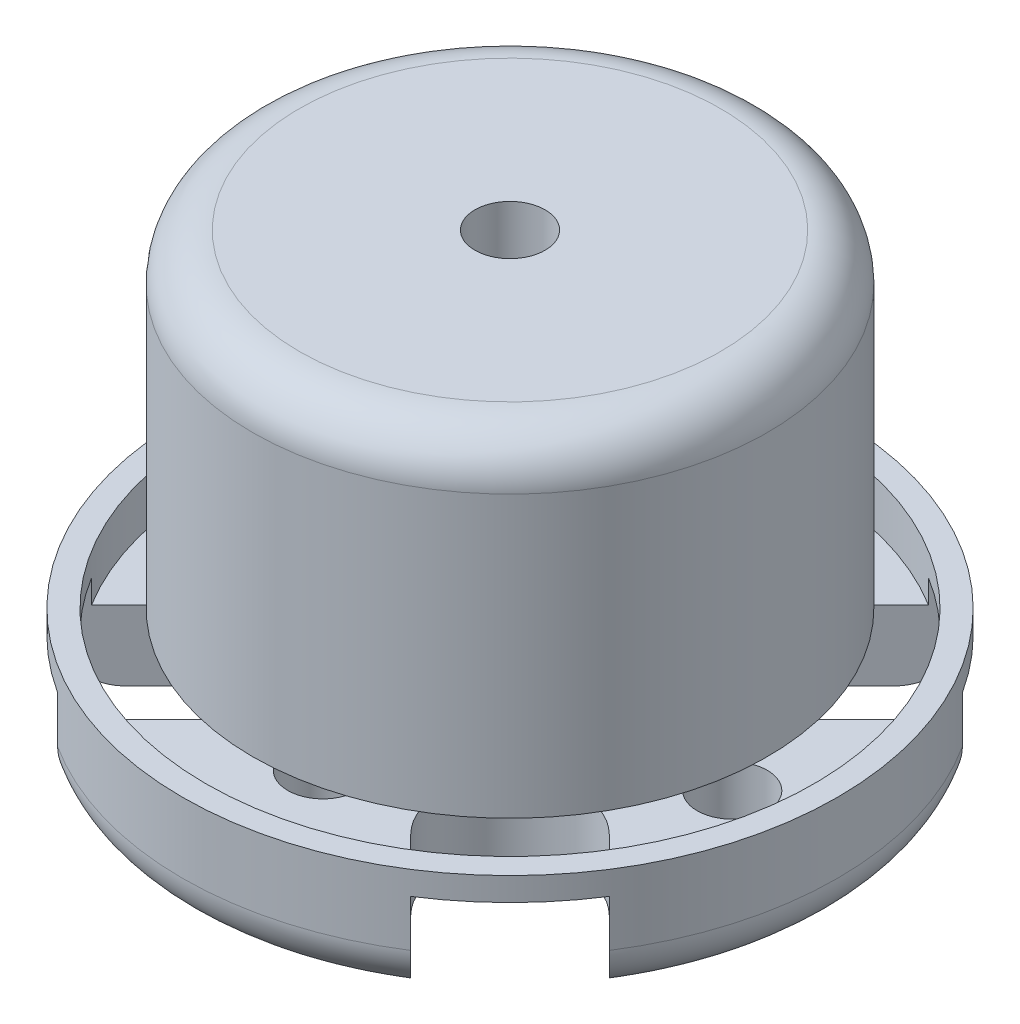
ISO-10303-21;
HEADER;
FILE_DESCRIPTION(('STEP AP214'),'2;1');
FILE_NAME('part.step','',(''),(''),'','','');
FILE_SCHEMA(('AUTOMOTIVE_DESIGN { 1 0 10303 214 1 1 1 1 }'));
ENDSEC;
DATA;
#1=APPLICATION_CONTEXT('core data for automotive mechanical design processes');
#2=APPLICATION_PROTOCOL_DEFINITION('international standard','automotive_design',2000,#1);
#3=PRODUCT_CONTEXT('',#1,'mechanical');
#4=PRODUCT('Part','Part','',(#3));
#5=PRODUCT_RELATED_PRODUCT_CATEGORY('part','',(#4));
#6=PRODUCT_DEFINITION_FORMATION('','',#4);
#7=PRODUCT_DEFINITION_CONTEXT('part definition',#1,'design');
#8=PRODUCT_DEFINITION('design','',#6,#7);
#9=PRODUCT_DEFINITION_SHAPE('','',#8);
#10=(LENGTH_UNIT() NAMED_UNIT(*) SI_UNIT(.MILLI.,.METRE.));
#11=(NAMED_UNIT(*) PLANE_ANGLE_UNIT() SI_UNIT($,.RADIAN.));
#12=(NAMED_UNIT(*) SI_UNIT($,.STERADIAN.) SOLID_ANGLE_UNIT());
#13=UNCERTAINTY_MEASURE_WITH_UNIT(LENGTH_MEASURE(1.E-05),#10,'distance_accuracy_value','');
#14=(GEOMETRIC_REPRESENTATION_CONTEXT(3) GLOBAL_UNCERTAINTY_ASSIGNED_CONTEXT((#13)) GLOBAL_UNIT_ASSIGNED_CONTEXT((#10,
#11,#12)) REPRESENTATION_CONTEXT('',''));
#15=CARTESIAN_POINT('',(0.,0.,0.));
#16=DIRECTION('',(0.,0.,1.));
#17=DIRECTION('',(1.,0.,0.));
#18=AXIS2_PLACEMENT_3D('',#15,#16,#17);
#19=CARTESIAN_POINT('',(0.,0.,0.));
#20=DIRECTION('',(0.,1.,0.));
#21=DIRECTION('',(0.,0.,1.));
#22=AXIS2_PLACEMENT_3D('',#19,#20,#21);
#23=CYLINDRICAL_SURFACE('',#22,1.5);
#24=CARTESIAN_POINT('',(0.,3.,0.));
#25=DIRECTION('',(0.,-1.,0.));
#26=DIRECTION('',(0.,0.,-1.));
#27=AXIS2_PLACEMENT_3D('',#24,#25,#26);
#28=CIRCLE('',#27,1.5);
#29=CARTESIAN_POINT('',(0.,3.,-1.5));
#30=VERTEX_POINT('',#29);
#31=EDGE_CURVE('E362',#30,#30,#28,.F.);
#32=ORIENTED_EDGE('',*,*,#31,.F.);
#33=EDGE_LOOP('',(#32));
#34=FACE_BOUND('',#33,.T.);
#35=CARTESIAN_POINT('',(0.,19.,0.));
#36=DIRECTION('',(0.,1.,0.));
#37=DIRECTION('',(0.,0.,1.));
#38=AXIS2_PLACEMENT_3D('',#35,#36,#37);
#39=CIRCLE('',#38,1.5);
#40=CARTESIAN_POINT('',(0.,19.,1.5));
#41=VERTEX_POINT('',#40);
#42=EDGE_CURVE('E947',#41,#41,#39,.T.);
#43=ORIENTED_EDGE('',*,*,#42,.T.);
#44=EDGE_LOOP('',(#43));
#45=FACE_BOUND('',#44,.T.);
#46=ADVANCED_FACE('F36',(#34,#45),#23,.F.);
#47=CARTESIAN_POINT('',(-9.5,5.,0.));
#48=DIRECTION('',(0.,-1.,0.));
#49=DIRECTION('',(0.,0.,-1.));
#50=AXIS2_PLACEMENT_3D('',#47,#48,#49);
#51=CYLINDRICAL_SURFACE('',#50,1.5);
#52=CARTESIAN_POINT('',(-9.5,0.,0.));
#53=DIRECTION('',(0.,1.,0.));
#54=DIRECTION('',(0.,0.,1.));
#55=AXIS2_PLACEMENT_3D('',#52,#53,#54);
#56=CIRCLE('',#55,1.5);
#57=CARTESIAN_POINT('',(-9.5,0.,1.5));
#58=VERTEX_POINT('',#57);
#59=EDGE_CURVE('E398',#58,#58,#56,.T.);
#60=ORIENTED_EDGE('',*,*,#59,.F.);
#61=EDGE_LOOP('',(#60));
#62=FACE_BOUND('',#61,.T.);
#63=CARTESIAN_POINT('',(-9.5,3.,0.));
#64=DIRECTION('',(0.,1.,0.));
#65=DIRECTION('',(0.,0.,1.));
#66=AXIS2_PLACEMENT_3D('',#63,#64,#65);
#67=CIRCLE('',#66,1.5);
#68=CARTESIAN_POINT('',(-9.5,3.,1.5));
#69=VERTEX_POINT('',#68);
#70=EDGE_CURVE('E386',#69,#69,#67,.T.);
#71=ORIENTED_EDGE('',*,*,#70,.T.);
#72=EDGE_LOOP('',(#71));
#73=FACE_BOUND('',#72,.T.);
#74=ADVANCED_FACE('F529',(#62,#73),#51,.F.);
#75=CARTESIAN_POINT('',(9.5,5.,0.));
#76=DIRECTION('',(0.,-1.,0.));
#77=DIRECTION('',(0.,0.,-1.));
#78=AXIS2_PLACEMENT_3D('',#75,#76,#77);
#79=CYLINDRICAL_SURFACE('',#78,1.5);
#80=CARTESIAN_POINT('',(9.5,0.,0.));
#81=DIRECTION('',(0.,1.,0.));
#82=DIRECTION('',(0.,0.,1.));
#83=AXIS2_PLACEMENT_3D('',#80,#81,#82);
#84=CIRCLE('',#83,1.5);
#85=CARTESIAN_POINT('',(9.5,0.,1.5));
#86=VERTEX_POINT('',#85);
#87=EDGE_CURVE('E395',#86,#86,#84,.T.);
#88=ORIENTED_EDGE('',*,*,#87,.F.);
#89=EDGE_LOOP('',(#88));
#90=FACE_BOUND('',#89,.T.);
#91=CARTESIAN_POINT('',(9.5,3.,0.));
#92=DIRECTION('',(0.,1.,0.));
#93=DIRECTION('',(0.,0.,1.));
#94=AXIS2_PLACEMENT_3D('',#91,#92,#93);
#95=CIRCLE('',#94,1.5);
#96=CARTESIAN_POINT('',(9.5,3.,1.5));
#97=VERTEX_POINT('',#96);
#98=EDGE_CURVE('E383',#97,#97,#95,.T.);
#99=ORIENTED_EDGE('',*,*,#98,.T.);
#100=EDGE_LOOP('',(#99));
#101=FACE_BOUND('',#100,.T.);
#102=ADVANCED_FACE('F535',(#90,#101),#79,.F.);
#103=CARTESIAN_POINT('',(0.,5.,-8.));
#104=DIRECTION('',(0.,-1.,0.));
#105=DIRECTION('',(0.,0.,-1.));
#106=AXIS2_PLACEMENT_3D('',#103,#104,#105);
#107=CYLINDRICAL_SURFACE('',#106,1.5);
#108=CARTESIAN_POINT('',(0.,0.,-8.));
#109=DIRECTION('',(0.,1.,0.));
#110=DIRECTION('',(0.,0.,1.));
#111=AXIS2_PLACEMENT_3D('',#108,#109,#110);
#112=CIRCLE('',#111,1.5);
#113=CARTESIAN_POINT('',(0.,0.,-6.5));
#114=VERTEX_POINT('',#113);
#115=EDGE_CURVE('E392',#114,#114,#112,.T.);
#116=ORIENTED_EDGE('',*,*,#115,.F.);
#117=EDGE_LOOP('',(#116));
#118=FACE_BOUND('',#117,.T.);
#119=CARTESIAN_POINT('',(0.,3.,-8.));
#120=DIRECTION('',(0.,1.,0.));
#121=DIRECTION('',(0.,0.,1.));
#122=AXIS2_PLACEMENT_3D('',#119,#120,#121);
#123=CIRCLE('',#122,1.5);
#124=CARTESIAN_POINT('',(0.,3.,-6.5));
#125=VERTEX_POINT('',#124);
#126=EDGE_CURVE('E380',#125,#125,#123,.T.);
#127=ORIENTED_EDGE('',*,*,#126,.T.);
#128=EDGE_LOOP('',(#127));
#129=FACE_BOUND('',#128,.T.);
#130=ADVANCED_FACE('F561',(#118,#129),#107,.F.);
#131=CARTESIAN_POINT('',(0.,5.,8.));
#132=DIRECTION('',(0.,-1.,0.));
#133=DIRECTION('',(0.,0.,-1.));
#134=AXIS2_PLACEMENT_3D('',#131,#132,#133);
#135=CYLINDRICAL_SURFACE('',#134,1.5);
#136=CARTESIAN_POINT('',(0.,0.,8.));
#137=DIRECTION('',(0.,1.,0.));
#138=DIRECTION('',(0.,0.,1.));
#139=AXIS2_PLACEMENT_3D('',#136,#137,#138);
#140=CIRCLE('',#139,1.5);
#141=CARTESIAN_POINT('',(0.,0.,9.5));
#142=VERTEX_POINT('',#141);
#143=EDGE_CURVE('E389',#142,#142,#140,.T.);
#144=ORIENTED_EDGE('',*,*,#143,.F.);
#145=EDGE_LOOP('',(#144));
#146=FACE_BOUND('',#145,.T.);
#147=CARTESIAN_POINT('',(0.,3.,8.));
#148=DIRECTION('',(0.,1.,0.));
#149=DIRECTION('',(0.,0.,1.));
#150=AXIS2_PLACEMENT_3D('',#147,#148,#149);
#151=CIRCLE('',#150,1.5);
#152=CARTESIAN_POINT('',(0.,3.,9.5));
#153=VERTEX_POINT('',#152);
#154=EDGE_CURVE('E375',#153,#153,#151,.T.);
#155=ORIENTED_EDGE('',*,*,#154,.T.);
#156=EDGE_LOOP('',(#155));
#157=FACE_BOUND('',#156,.T.);
#158=ADVANCED_FACE('F557',(#146,#157),#135,.F.);
#159=CARTESIAN_POINT('',(0.,5.,0.));
#160=DIRECTION('',(0.,1.,0.));
#161=DIRECTION('',(0.,0.,1.));
#162=AXIS2_PLACEMENT_3D('',#159,#160,#161);
#163=PLANE('',#162);
#164=CARTESIAN_POINT('',(0.,5.,0.));
#165=DIRECTION('',(0.,1.,0.));
#166=DIRECTION('',(0.,0.,1.));
#167=AXIS2_PLACEMENT_3D('',#164,#165,#166);
#168=CIRCLE('',#167,13.);
#169=CARTESIAN_POINT('',(0.,5.,13.));
#170=VERTEX_POINT('',#169);
#171=EDGE_CURVE('E368',#170,#170,#168,.T.);
#172=ORIENTED_EDGE('',*,*,#171,.F.);
#173=EDGE_LOOP('',(#172));
#174=FACE_BOUND('',#173,.T.);
#175=CARTESIAN_POINT('',(0.,5.,0.));
#176=DIRECTION('',(0.,1.,0.));
#177=DIRECTION('',(0.,0.,1.));
#178=AXIS2_PLACEMENT_3D('',#175,#176,#177);
#179=CIRCLE('',#178,14.);
#180=CARTESIAN_POINT('',(0.,5.,14.));
#181=VERTEX_POINT('',#180);
#182=EDGE_CURVE('E401',#181,#181,#179,.T.);
#183=ORIENTED_EDGE('',*,*,#182,.T.);
#184=EDGE_LOOP('',(#183));
#185=FACE_BOUND('',#184,.T.);
#186=ADVANCED_FACE('F560',(#174,#185),#163,.T.);
#187=CARTESIAN_POINT('',(0.,0.,0.));
#188=DIRECTION('',(0.,1.,0.));
#189=DIRECTION('',(0.,0.,1.));
#190=AXIS2_PLACEMENT_3D('',#187,#188,#189);
#191=PLANE('',#190);
#192=CARTESIAN_POINT('',(0.,0.,0.));
#193=DIRECTION('',(0.,-1.,0.));
#194=DIRECTION('',(0.,0.,-1.));
#195=AXIS2_PLACEMENT_3D('',#192,#193,#194);
#196=CIRCLE('',#195,4.);
#197=CARTESIAN_POINT('',(0.,0.,-4.));
#198=VERTEX_POINT('',#197);
#199=EDGE_CURVE('E358',#198,#198,#196,.T.);
#200=ORIENTED_EDGE('',*,*,#199,.F.);
#201=EDGE_LOOP('',(#200));
#202=FACE_BOUND('',#201,.T.);
#203=ORIENTED_EDGE('',*,*,#115,.T.);
#204=EDGE_LOOP('',(#203));
#205=FACE_BOUND('',#204,.T.);
#206=ORIENTED_EDGE('',*,*,#59,.T.);
#207=EDGE_LOOP('',(#206));
#208=FACE_BOUND('',#207,.T.);
#209=DIRECTION('',(0.707106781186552,0.,0.707106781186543));
#210=VECTOR('',#209,1.);
#211=CARTESIAN_POINT('',(-4.24264068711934,0.,-8.48528137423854));
#212=LINE('',#211,#210);
#213=CARTESIAN_POINT('',(-6.09451801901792,0.,-10.3371587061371));
#214=VERTEX_POINT('',#213);
#215=CARTESIAN_POINT('',(-4.24264068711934,0.,-8.48528137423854));
#216=VERTEX_POINT('',#215);
#217=EDGE_CURVE('E267',#214,#216,#212,.T.);
#218=ORIENTED_EDGE('',*,*,#217,.F.);
#219=CARTESIAN_POINT('',(0.,0.,0.));
#220=DIRECTION('',(0.,1.,0.));
#221=DIRECTION('',(0.,0.,1.));
#222=AXIS2_PLACEMENT_3D('',#219,#220,#221);
#223=CIRCLE('',#222,12.);
#224=CARTESIAN_POINT('',(6.09451801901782,0.,-10.3371587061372));
#225=VERTEX_POINT('',#224);
#226=EDGE_CURVE('E923',#214,#225,#223,.F.);
#227=ORIENTED_EDGE('',*,*,#226,.T.);
#228=DIRECTION('',(0.707106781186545,0.,-0.70710678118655));
#229=VECTOR('',#228,1.);
#230=CARTESIAN_POINT('',(4.24264068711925,0.,-8.48528137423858));
#231=LINE('',#230,#229);
#232=CARTESIAN_POINT('',(4.24264068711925,0.,-8.48528137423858));
#233=VERTEX_POINT('',#232);
#234=EDGE_CURVE('E307',#233,#225,#231,.T.);
#235=ORIENTED_EDGE('',*,*,#234,.F.);
#236=CARTESIAN_POINT('',(6.3639610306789,0.,-6.36396103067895));
#237=DIRECTION('',(0.,-1.,0.));
#238=DIRECTION('',(0.,0.,-1.));
#239=AXIS2_PLACEMENT_3D('',#236,#237,#238);
#240=CIRCLE('',#239,3.);
#241=CARTESIAN_POINT('',(8.48528137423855,0.,-4.24264068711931));
#242=VERTEX_POINT('',#241);
#243=EDGE_CURVE('E294',#242,#233,#240,.T.);
#244=ORIENTED_EDGE('',*,*,#243,.F.);
#245=DIRECTION('',(-0.707106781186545,0.,0.70710678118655));
#246=VECTOR('',#245,1.);
#247=CARTESIAN_POINT('',(8.48528137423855,0.,-4.24264068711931));
#248=LINE('',#247,#246);
#249=CARTESIAN_POINT('',(10.3371587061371,0.,-6.09451801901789));
#250=VERTEX_POINT('',#249);
#251=EDGE_CURVE('E299',#250,#242,#248,.T.);
#252=ORIENTED_EDGE('',*,*,#251,.F.);
#253=CARTESIAN_POINT('',(0.,0.,0.));
#254=DIRECTION('',(0.,1.,0.));
#255=DIRECTION('',(0.,0.,1.));
#256=AXIS2_PLACEMENT_3D('',#253,#254,#255);
#257=CIRCLE('',#256,12.);
#258=CARTESIAN_POINT('',(10.3371587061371,0.,6.09451801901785));
#259=VERTEX_POINT('',#258);
#260=EDGE_CURVE('E904',#250,#259,#257,.F.);
#261=ORIENTED_EDGE('',*,*,#260,.T.);
#262=DIRECTION('',(0.707106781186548,0.,0.707106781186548));
#263=VECTOR('',#262,1.);
#264=CARTESIAN_POINT('',(8.48528137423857,0.,4.24264068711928));
#265=LINE('',#264,#263);
#266=CARTESIAN_POINT('',(8.48528137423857,0.,4.24264068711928));
#267=VERTEX_POINT('',#266);
#268=EDGE_CURVE('E339',#267,#259,#265,.T.);
#269=ORIENTED_EDGE('',*,*,#268,.F.);
#270=CARTESIAN_POINT('',(6.36396103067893,0.,6.36396103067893));
#271=DIRECTION('',(0.,-1.,0.));
#272=DIRECTION('',(0.,0.,-1.));
#273=AXIS2_PLACEMENT_3D('',#270,#271,#272);
#274=CIRCLE('',#273,3.);
#275=CARTESIAN_POINT('',(4.24264068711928,0.,8.48528137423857));
#276=VERTEX_POINT('',#275);
#277=EDGE_CURVE('E326',#276,#267,#274,.T.);
#278=ORIENTED_EDGE('',*,*,#277,.F.);
#279=DIRECTION('',(-0.707106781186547,0.,-0.707106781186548));
#280=VECTOR('',#279,1.);
#281=CARTESIAN_POINT('',(4.24264068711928,0.,8.48528137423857));
#282=LINE('',#281,#280);
#283=CARTESIAN_POINT('',(6.09451801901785,0.,10.3371587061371));
#284=VERTEX_POINT('',#283);
#285=EDGE_CURVE('E331',#284,#276,#282,.T.);
#286=ORIENTED_EDGE('',*,*,#285,.F.);
#287=CARTESIAN_POINT('',(0.,0.,0.));
#288=DIRECTION('',(0.,1.,0.));
#289=DIRECTION('',(0.,0.,1.));
#290=AXIS2_PLACEMENT_3D('',#287,#288,#289);
#291=CIRCLE('',#290,12.);
#292=CARTESIAN_POINT('',(-6.09451801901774,0.,10.3371587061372));
#293=VERTEX_POINT('',#292);
#294=EDGE_CURVE('E51',#284,#293,#291,.F.);
#295=ORIENTED_EDGE('',*,*,#294,.T.);
#296=DIRECTION('',(-0.70710678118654,0.,0.707106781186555));
#297=VECTOR('',#296,1.);
#298=CARTESIAN_POINT('',(-4.2426406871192,0.,8.48528137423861));
#299=LINE('',#298,#297);
#300=CARTESIAN_POINT('',(-4.2426406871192,0.,8.48528137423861));
#301=VERTEX_POINT('',#300);
#302=EDGE_CURVE('E938',#301,#293,#299,.T.);
#303=ORIENTED_EDGE('',*,*,#302,.F.);
#304=CARTESIAN_POINT('',(-6.36396103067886,0.,6.36396103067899));
#305=DIRECTION('',(0.,-1.,0.));
#306=DIRECTION('',(0.,0.,-1.));
#307=AXIS2_PLACEMENT_3D('',#304,#305,#306);
#308=CIRCLE('',#307,3.);
#309=CARTESIAN_POINT('',(-8.48528137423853,0.,4.24264068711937));
#310=VERTEX_POINT('',#309);
#311=EDGE_CURVE('E941',#310,#301,#308,.T.);
#312=ORIENTED_EDGE('',*,*,#311,.F.);
#313=DIRECTION('',(0.70710678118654,0.,-0.707106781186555));
#314=VECTOR('',#313,1.);
#315=CARTESIAN_POINT('',(-8.48528137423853,0.,4.24264068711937));
#316=LINE('',#315,#314);
#317=CARTESIAN_POINT('',(-10.3371587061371,0.,6.09451801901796));
#318=VERTEX_POINT('',#317);
#319=EDGE_CURVE('E933',#318,#310,#316,.T.);
#320=ORIENTED_EDGE('',*,*,#319,.F.);
#321=CARTESIAN_POINT('',(0.,0.,0.));
#322=DIRECTION('',(0.,1.,0.));
#323=DIRECTION('',(0.,0.,1.));
#324=AXIS2_PLACEMENT_3D('',#321,#322,#323);
#325=CIRCLE('',#324,12.);
#326=CARTESIAN_POINT('',(-10.3371587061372,0.,-6.09451801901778));
#327=VERTEX_POINT('',#326);
#328=EDGE_CURVE('E925',#318,#327,#325,.F.);
#329=ORIENTED_EDGE('',*,*,#328,.T.);
#330=DIRECTION('',(-0.707106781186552,0.,-0.707106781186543));
#331=VECTOR('',#330,1.);
#332=CARTESIAN_POINT('',(-8.4852813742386,0.,-4.24264068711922));
#333=LINE('',#332,#331);
#334=CARTESIAN_POINT('',(-8.4852813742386,0.,-4.24264068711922));
#335=VERTEX_POINT('',#334);
#336=EDGE_CURVE('E275',#335,#327,#333,.T.);
#337=ORIENTED_EDGE('',*,*,#336,.F.);
#338=CARTESIAN_POINT('',(-6.36396103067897,0.,-6.36396103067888));
#339=DIRECTION('',(0.,-1.,0.));
#340=DIRECTION('',(0.,0.,-1.));
#341=AXIS2_PLACEMENT_3D('',#338,#339,#340);
#342=CIRCLE('',#341,3.);
#343=EDGE_CURVE('E262',#216,#335,#342,.T.);
#344=ORIENTED_EDGE('',*,*,#343,.F.);
#345=EDGE_LOOP('',(#218,#227,#235,#244,#252,#261,#269,#278,#286,#295,#303,#312,#320,#329,#337,#344));
#346=FACE_BOUND('',#345,.T.);
#347=ORIENTED_EDGE('',*,*,#87,.T.);
#348=EDGE_LOOP('',(#347));
#349=FACE_BOUND('',#348,.T.);
#350=ORIENTED_EDGE('',*,*,#143,.T.);
#351=EDGE_LOOP('',(#350));
#352=FACE_BOUND('',#351,.T.);
#353=ADVANCED_FACE('F571',(#202,#205,#208,#346,#349,#352),#191,.F.);
#354=CARTESIAN_POINT('',(0.,5.,0.));
#355=DIRECTION('',(0.,-1.,0.));
#356=DIRECTION('',(0.,0.,-1.));
#357=AXIS2_PLACEMENT_3D('',#354,#355,#356);
#358=CYLINDRICAL_SURFACE('',#357,14.);
#359=DIRECTION('',(0.,-1.,0.));
#360=VECTOR('',#359,1.);
#361=CARTESIAN_POINT('',(7.54821945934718,4.,-11.7908601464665));
#362=LINE('',#361,#360);
#363=CARTESIAN_POINT('',(7.54821945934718,4.,-11.7908601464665));
#364=VERTEX_POINT('',#363);
#365=CARTESIAN_POINT('',(7.54821945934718,2.,-11.7908601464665));
#366=VERTEX_POINT('',#365);
#367=EDGE_CURVE('E318',#364,#366,#362,.T.);
#368=ORIENTED_EDGE('',*,*,#367,.T.);
#369=CARTESIAN_POINT('',(0.,2.,0.));
#370=DIRECTION('',(0.,1.,0.));
#371=DIRECTION('',(0.,0.,1.));
#372=AXIS2_PLACEMENT_3D('',#369,#370,#371);
#373=CIRCLE('',#372,14.);
#374=CARTESIAN_POINT('',(-7.5482194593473,2.,-11.7908601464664));
#375=VERTEX_POINT('',#374);
#376=EDGE_CURVE('E448',#366,#375,#373,.T.);
#377=ORIENTED_EDGE('',*,*,#376,.T.);
#378=DIRECTION('',(0.,-1.,0.));
#379=VECTOR('',#378,1.);
#380=CARTESIAN_POINT('',(-7.5482194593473,4.,-11.7908601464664));
#381=LINE('',#380,#379);
#382=CARTESIAN_POINT('',(-7.5482194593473,4.,-11.7908601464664));
#383=VERTEX_POINT('',#382);
#384=EDGE_CURVE('E283',#383,#375,#381,.T.);
#385=ORIENTED_EDGE('',*,*,#384,.F.);
#386=CARTESIAN_POINT('',(0.,4.,0.));
#387=DIRECTION('',(0.,-1.,0.));
#388=DIRECTION('',(0.,0.,-1.));
#389=AXIS2_PLACEMENT_3D('',#386,#387,#388);
#390=CIRCLE('',#389,14.);
#391=CARTESIAN_POINT('',(-11.7908601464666,4.,-7.54821945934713));
#392=VERTEX_POINT('',#391);
#393=EDGE_CURVE('E266',#392,#383,#390,.T.);
#394=ORIENTED_EDGE('',*,*,#393,.F.);
#395=DIRECTION('',(0.,-1.,0.));
#396=VECTOR('',#395,1.);
#397=CARTESIAN_POINT('',(-11.7908601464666,4.,-7.54821945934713));
#398=LINE('',#397,#396);
#399=CARTESIAN_POINT('',(-11.7908601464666,2.,-7.54821945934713));
#400=VERTEX_POINT('',#399);
#401=EDGE_CURVE('E286',#392,#400,#398,.T.);
#402=ORIENTED_EDGE('',*,*,#401,.T.);
#403=CARTESIAN_POINT('',(0.,2.,0.));
#404=DIRECTION('',(0.,1.,0.));
#405=DIRECTION('',(0.,0.,1.));
#406=AXIS2_PLACEMENT_3D('',#403,#404,#405);
#407=CIRCLE('',#406,14.);
#408=CARTESIAN_POINT('',(-11.7908601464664,2.,7.54821945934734));
#409=VERTEX_POINT('',#408);
#410=EDGE_CURVE('E248',#400,#409,#407,.T.);
#411=ORIENTED_EDGE('',*,*,#410,.T.);
#412=DIRECTION('',(0.,-1.,0.));
#413=VECTOR('',#412,1.);
#414=CARTESIAN_POINT('',(-11.7908601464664,4.,7.54821945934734));
#415=LINE('',#414,#413);
#416=CARTESIAN_POINT('',(-11.7908601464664,4.,7.54821945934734));
#417=VERTEX_POINT('',#416);
#418=EDGE_CURVE('E237',#417,#409,#415,.T.);
#419=ORIENTED_EDGE('',*,*,#418,.F.);
#420=CARTESIAN_POINT('',(0.,4.,0.));
#421=DIRECTION('',(0.,-1.,0.));
#422=DIRECTION('',(0.,0.,-1.));
#423=AXIS2_PLACEMENT_3D('',#420,#421,#422);
#424=CIRCLE('',#423,14.);
#425=CARTESIAN_POINT('',(-7.54821945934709,4.,11.7908601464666));
#426=VERTEX_POINT('',#425);
#427=EDGE_CURVE('E223',#426,#417,#424,.T.);
#428=ORIENTED_EDGE('',*,*,#427,.F.);
#429=DIRECTION('',(0.,-1.,0.));
#430=VECTOR('',#429,1.);
#431=CARTESIAN_POINT('',(-7.54821945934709,4.,11.7908601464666));
#432=LINE('',#431,#430);
#433=CARTESIAN_POINT('',(-7.54821945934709,2.,11.7908601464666));
#434=VERTEX_POINT('',#433);
#435=EDGE_CURVE('E250',#426,#434,#432,.T.);
#436=ORIENTED_EDGE('',*,*,#435,.T.);
#437=CARTESIAN_POINT('',(0.,2.,0.));
#438=DIRECTION('',(0.,1.,0.));
#439=DIRECTION('',(0.,0.,1.));
#440=AXIS2_PLACEMENT_3D('',#437,#438,#439);
#441=CIRCLE('',#440,14.);
#442=CARTESIAN_POINT('',(7.54821945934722,2.,11.7908601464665));
#443=VERTEX_POINT('',#442);
#444=EDGE_CURVE('E441',#434,#443,#441,.T.);
#445=ORIENTED_EDGE('',*,*,#444,.T.);
#446=DIRECTION('',(0.,-1.,0.));
#447=VECTOR('',#446,1.);
#448=CARTESIAN_POINT('',(7.54821945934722,4.,11.7908601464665));
#449=LINE('',#448,#447);
#450=CARTESIAN_POINT('',(7.54821945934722,4.,11.7908601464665));
#451=VERTEX_POINT('',#450);
#452=EDGE_CURVE('E347',#451,#443,#449,.T.);
#453=ORIENTED_EDGE('',*,*,#452,.F.);
#454=CARTESIAN_POINT('',(0.,4.,0.));
#455=DIRECTION('',(0.,-1.,0.));
#456=DIRECTION('',(0.,0.,-1.));
#457=AXIS2_PLACEMENT_3D('',#454,#455,#456);
#458=CIRCLE('',#457,14.);
#459=CARTESIAN_POINT('',(11.7908601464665,4.,7.54821945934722));
#460=VERTEX_POINT('',#459);
#461=EDGE_CURVE('E330',#460,#451,#458,.T.);
#462=ORIENTED_EDGE('',*,*,#461,.F.);
#463=DIRECTION('',(0.,-1.,0.));
#464=VECTOR('',#463,1.);
#465=CARTESIAN_POINT('',(11.7908601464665,4.,7.54821945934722));
#466=LINE('',#465,#464);
#467=CARTESIAN_POINT('',(11.7908601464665,2.,7.54821945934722));
#468=VERTEX_POINT('',#467);
#469=EDGE_CURVE('E349',#460,#468,#466,.T.);
#470=ORIENTED_EDGE('',*,*,#469,.T.);
#471=CARTESIAN_POINT('',(0.,2.,0.));
#472=DIRECTION('',(0.,1.,0.));
#473=DIRECTION('',(0.,0.,1.));
#474=AXIS2_PLACEMENT_3D('',#471,#472,#473);
#475=CIRCLE('',#474,14.);
#476=CARTESIAN_POINT('',(11.7908601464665,2.,-7.54821945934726));
#477=VERTEX_POINT('',#476);
#478=EDGE_CURVE('E445',#468,#477,#475,.T.);
#479=ORIENTED_EDGE('',*,*,#478,.T.);
#480=DIRECTION('',(0.,-1.,0.));
#481=VECTOR('',#480,1.);
#482=CARTESIAN_POINT('',(11.7908601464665,4.,-7.54821945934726));
#483=LINE('',#482,#481);
#484=CARTESIAN_POINT('',(11.7908601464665,4.,-7.54821945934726));
#485=VERTEX_POINT('',#484);
#486=EDGE_CURVE('E315',#485,#477,#483,.T.);
#487=ORIENTED_EDGE('',*,*,#486,.F.);
#488=CARTESIAN_POINT('',(0.,4.,0.));
#489=DIRECTION('',(0.,-1.,0.));
#490=DIRECTION('',(0.,0.,-1.));
#491=AXIS2_PLACEMENT_3D('',#488,#489,#490);
#492=CIRCLE('',#491,14.);
#493=EDGE_CURVE('E298',#364,#485,#492,.T.);
#494=ORIENTED_EDGE('',*,*,#493,.F.);
#495=EDGE_LOOP('',(#368,#377,#385,#394,#402,#411,#419,#428,#436,#445,#453,#462,#470,#479,#487,#494));
#496=FACE_BOUND('',#495,.T.);
#497=ORIENTED_EDGE('',*,*,#182,.F.);
#498=EDGE_LOOP('',(#497));
#499=FACE_BOUND('',#498,.T.);
#500=ADVANCED_FACE('F244',(#496,#499),#358,.T.);
#501=CARTESIAN_POINT('',(0.,3.,0.));
#502=DIRECTION('',(0.,1.,0.));
#503=DIRECTION('',(0.,0.,1.));
#504=AXIS2_PLACEMENT_3D('',#501,#502,#503);
#505=CYLINDRICAL_SURFACE('',#504,13.);
#506=CARTESIAN_POINT('',(0.,4.,0.));
#507=DIRECTION('',(0.,-1.,0.));
#508=DIRECTION('',(0.,0.,-1.));
#509=AXIS2_PLACEMENT_3D('',#506,#507,#508);
#510=CIRCLE('',#509,13.);
#511=CARTESIAN_POINT('',(-11.0655922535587,4.,6.82295156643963));
#512=VERTEX_POINT('',#511);
#513=CARTESIAN_POINT('',(-6.8229515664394,4.,11.0655922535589));
#514=VERTEX_POINT('',#513);
#515=EDGE_CURVE('E439',#512,#514,#510,.F.);
#516=ORIENTED_EDGE('',*,*,#515,.F.);
#517=DIRECTION('',(0.,1.,0.));
#518=VECTOR('',#517,1.);
#519=CARTESIAN_POINT('',(-11.0655922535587,3.,6.82295156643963));
#520=LINE('',#519,#518);
#521=CARTESIAN_POINT('',(-11.0655922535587,3.,6.82295156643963));
#522=VERTEX_POINT('',#521);
#523=EDGE_CURVE('E239',#512,#522,#520,.F.);
#524=ORIENTED_EDGE('',*,*,#523,.T.);
#525=CARTESIAN_POINT('',(0.,3.,0.));
#526=DIRECTION('',(0.,1.,0.));
#527=DIRECTION('',(0.,0.,1.));
#528=AXIS2_PLACEMENT_3D('',#525,#526,#527);
#529=CIRCLE('',#528,13.);
#530=CARTESIAN_POINT('',(-11.0655922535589,3.,-6.82295156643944));
#531=VERTEX_POINT('',#530);
#532=EDGE_CURVE('E999',#531,#522,#529,.T.);
#533=ORIENTED_EDGE('',*,*,#532,.F.);
#534=DIRECTION('',(0.,1.,0.));
#535=VECTOR('',#534,1.);
#536=CARTESIAN_POINT('',(-11.0655922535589,3.,-6.82295156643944));
#537=LINE('',#536,#535);
#538=CARTESIAN_POINT('',(-11.0655922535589,4.,-6.82295156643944));
#539=VERTEX_POINT('',#538);
#540=EDGE_CURVE('E282',#531,#539,#537,.T.);
#541=ORIENTED_EDGE('',*,*,#540,.T.);
#542=CARTESIAN_POINT('',(0.,4.,0.));
#543=DIRECTION('',(0.,-1.,0.));
#544=DIRECTION('',(0.,0.,-1.));
#545=AXIS2_PLACEMENT_3D('',#542,#543,#544);
#546=CIRCLE('',#545,13.);
#547=CARTESIAN_POINT('',(-6.8229515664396,4.,-11.0655922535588));
#548=VERTEX_POINT('',#547);
#549=EDGE_CURVE('E431',#548,#539,#546,.F.);
#550=ORIENTED_EDGE('',*,*,#549,.F.);
#551=DIRECTION('',(0.,1.,0.));
#552=VECTOR('',#551,1.);
#553=CARTESIAN_POINT('',(-6.8229515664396,3.,-11.0655922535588));
#554=LINE('',#553,#552);
#555=CARTESIAN_POINT('',(-6.8229515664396,3.,-11.0655922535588));
#556=VERTEX_POINT('',#555);
#557=EDGE_CURVE('E291',#548,#556,#554,.F.);
#558=ORIENTED_EDGE('',*,*,#557,.T.);
#559=CARTESIAN_POINT('',(6.82295156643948,3.,-11.0655922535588));
#560=VERTEX_POINT('',#559);
#561=EDGE_CURVE('E376',#560,#556,#529,.T.);
#562=ORIENTED_EDGE('',*,*,#561,.F.);
#563=DIRECTION('',(0.,1.,0.));
#564=VECTOR('',#563,1.);
#565=CARTESIAN_POINT('',(6.82295156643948,3.,-11.0655922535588));
#566=LINE('',#565,#564);
#567=CARTESIAN_POINT('',(6.82295156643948,4.,-11.0655922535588));
#568=VERTEX_POINT('',#567);
#569=EDGE_CURVE('E314',#560,#568,#566,.T.);
#570=ORIENTED_EDGE('',*,*,#569,.T.);
#571=CARTESIAN_POINT('',(0.,4.,0.));
#572=DIRECTION('',(0.,-1.,0.));
#573=DIRECTION('',(0.,0.,-1.));
#574=AXIS2_PLACEMENT_3D('',#571,#572,#573);
#575=CIRCLE('',#574,13.);
#576=CARTESIAN_POINT('',(11.0655922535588,4.,-6.82295156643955));
#577=VERTEX_POINT('',#576);
#578=EDGE_CURVE('E423',#577,#568,#575,.F.);
#579=ORIENTED_EDGE('',*,*,#578,.F.);
#580=DIRECTION('',(0.,1.,0.));
#581=VECTOR('',#580,1.);
#582=CARTESIAN_POINT('',(11.0655922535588,3.,-6.82295156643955));
#583=LINE('',#582,#581);
#584=CARTESIAN_POINT('',(11.0655922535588,3.,-6.82295156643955));
#585=VERTEX_POINT('',#584);
#586=EDGE_CURVE('E323',#577,#585,#583,.F.);
#587=ORIENTED_EDGE('',*,*,#586,.T.);
#588=CARTESIAN_POINT('',(11.0655922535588,3.,6.82295156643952));
#589=VERTEX_POINT('',#588);
#590=EDGE_CURVE('E372',#589,#585,#529,.T.);
#591=ORIENTED_EDGE('',*,*,#590,.F.);
#592=DIRECTION('',(0.,1.,0.));
#593=VECTOR('',#592,1.);
#594=CARTESIAN_POINT('',(11.0655922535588,3.,6.82295156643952));
#595=LINE('',#594,#593);
#596=CARTESIAN_POINT('',(11.0655922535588,4.,6.82295156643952));
#597=VERTEX_POINT('',#596);
#598=EDGE_CURVE('E346',#589,#597,#595,.T.);
#599=ORIENTED_EDGE('',*,*,#598,.T.);
#600=CARTESIAN_POINT('',(0.,4.,0.));
#601=DIRECTION('',(0.,-1.,0.));
#602=DIRECTION('',(0.,0.,-1.));
#603=AXIS2_PLACEMENT_3D('',#600,#601,#602);
#604=CIRCLE('',#603,13.);
#605=CARTESIAN_POINT('',(6.82295156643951,4.,11.0655922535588));
#606=VERTEX_POINT('',#605);
#607=EDGE_CURVE('E415',#606,#597,#604,.F.);
#608=ORIENTED_EDGE('',*,*,#607,.F.);
#609=DIRECTION('',(0.,1.,0.));
#610=VECTOR('',#609,1.);
#611=CARTESIAN_POINT('',(6.82295156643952,3.,11.0655922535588));
#612=LINE('',#611,#610);
#613=CARTESIAN_POINT('',(6.82295156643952,3.,11.0655922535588));
#614=VERTEX_POINT('',#613);
#615=EDGE_CURVE('E355',#606,#614,#612,.F.);
#616=ORIENTED_EDGE('',*,*,#615,.T.);
#617=CARTESIAN_POINT('',(-6.8229515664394,3.,11.0655922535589));
#618=VERTEX_POINT('',#617);
#619=EDGE_CURVE('E377',#618,#614,#529,.T.);
#620=ORIENTED_EDGE('',*,*,#619,.F.);
#621=DIRECTION('',(0.,1.,0.));
#622=VECTOR('',#621,1.);
#623=CARTESIAN_POINT('',(-6.8229515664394,3.,11.0655922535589));
#624=LINE('',#623,#622);
#625=EDGE_CURVE('E253',#618,#514,#624,.T.);
#626=ORIENTED_EDGE('',*,*,#625,.T.);
#627=EDGE_LOOP('',(#516,#524,#533,#541,#550,#558,#562,#570,#579,#587,#591,#599,#608,#616,#620,#626));
#628=FACE_BOUND('',#627,.T.);
#629=ORIENTED_EDGE('',*,*,#171,.T.);
#630=EDGE_LOOP('',(#629));
#631=FACE_BOUND('',#630,.T.);
#632=ADVANCED_FACE('F552',(#628,#631),#505,.F.);
#633=CARTESIAN_POINT('',(0.,3.,0.));
#634=DIRECTION('',(0.,1.,0.));
#635=DIRECTION('',(0.,0.,1.));
#636=AXIS2_PLACEMENT_3D('',#633,#634,#635);
#637=PLANE('',#636);
#638=DIRECTION('',(-0.70710678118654,0.,0.707106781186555));
#639=VECTOR('',#638,1.);
#640=CARTESIAN_POINT('',(-2.12132034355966,3.,-2.12132034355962));
#641=LINE('',#640,#639);
#642=CARTESIAN_POINT('',(-8.48528137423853,3.,4.24264068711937));
#643=VERTEX_POINT('',#642);
#644=EDGE_CURVE('E437',#643,#522,#641,.T.);
#645=ORIENTED_EDGE('',*,*,#644,.F.);
#646=CARTESIAN_POINT('',(-6.36396103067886,3.,6.36396103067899));
#647=DIRECTION('',(0.,1.,0.));
#648=DIRECTION('',(0.,0.,1.));
#649=AXIS2_PLACEMENT_3D('',#646,#647,#648);
#650=CIRCLE('',#649,3.);
#651=CARTESIAN_POINT('',(-4.2426406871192,3.,8.48528137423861));
#652=VERTEX_POINT('',#651);
#653=EDGE_CURVE('E435',#652,#643,#650,.T.);
#654=ORIENTED_EDGE('',*,*,#653,.F.);
#655=DIRECTION('',(0.70710678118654,0.,-0.707106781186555));
#656=VECTOR('',#655,1.);
#657=CARTESIAN_POINT('',(2.12132034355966,3.,2.12132034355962));
#658=LINE('',#657,#656);
#659=EDGE_CURVE('E433',#618,#652,#658,.T.);
#660=ORIENTED_EDGE('',*,*,#659,.F.);
#661=ORIENTED_EDGE('',*,*,#619,.T.);
#662=DIRECTION('',(0.707106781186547,0.,0.707106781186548));
#663=VECTOR('',#662,1.);
#664=CARTESIAN_POINT('',(-2.12132034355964,3.,2.12132034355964));
#665=LINE('',#664,#663);
#666=CARTESIAN_POINT('',(4.24264068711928,3.,8.48528137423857));
#667=VERTEX_POINT('',#666);
#668=EDGE_CURVE('E412',#667,#614,#665,.T.);
#669=ORIENTED_EDGE('',*,*,#668,.F.);
#670=CARTESIAN_POINT('',(6.36396103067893,3.,6.36396103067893));
#671=DIRECTION('',(0.,1.,0.));
#672=DIRECTION('',(0.,0.,1.));
#673=AXIS2_PLACEMENT_3D('',#670,#671,#672);
#674=CIRCLE('',#673,3.);
#675=CARTESIAN_POINT('',(8.48528137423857,3.,4.24264068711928));
#676=VERTEX_POINT('',#675);
#677=EDGE_CURVE('E410',#676,#667,#674,.T.);
#678=ORIENTED_EDGE('',*,*,#677,.F.);
#679=DIRECTION('',(-0.707106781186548,0.,-0.707106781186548));
#680=VECTOR('',#679,1.);
#681=CARTESIAN_POINT('',(2.12132034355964,3.,-2.12132034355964));
#682=LINE('',#681,#680);
#683=EDGE_CURVE('E404',#589,#676,#682,.T.);
#684=ORIENTED_EDGE('',*,*,#683,.F.);
#685=ORIENTED_EDGE('',*,*,#590,.T.);
#686=DIRECTION('',(0.707106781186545,0.,-0.70710678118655));
#687=VECTOR('',#686,1.);
#688=CARTESIAN_POINT('',(2.12132034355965,3.,2.12132034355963));
#689=LINE('',#688,#687);
#690=CARTESIAN_POINT('',(8.48528137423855,3.,-4.24264068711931));
#691=VERTEX_POINT('',#690);
#692=EDGE_CURVE('E421',#691,#585,#689,.T.);
#693=ORIENTED_EDGE('',*,*,#692,.F.);
#694=CARTESIAN_POINT('',(6.3639610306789,3.,-6.36396103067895));
#695=DIRECTION('',(0.,1.,0.));
#696=DIRECTION('',(0.,0.,1.));
#697=AXIS2_PLACEMENT_3D('',#694,#695,#696);
#698=CIRCLE('',#697,3.);
#699=CARTESIAN_POINT('',(4.24264068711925,3.,-8.48528137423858));
#700=VERTEX_POINT('',#699);
#701=EDGE_CURVE('E419',#700,#691,#698,.T.);
#702=ORIENTED_EDGE('',*,*,#701,.F.);
#703=DIRECTION('',(-0.707106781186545,0.,0.70710678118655));
#704=VECTOR('',#703,1.);
#705=CARTESIAN_POINT('',(-2.12132034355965,3.,-2.12132034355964));
#706=LINE('',#705,#704);
#707=EDGE_CURVE('E417',#560,#700,#706,.T.);
#708=ORIENTED_EDGE('',*,*,#707,.F.);
#709=ORIENTED_EDGE('',*,*,#561,.T.);
#710=DIRECTION('',(-0.707106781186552,0.,-0.707106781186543));
#711=VECTOR('',#710,1.);
#712=CARTESIAN_POINT('',(2.12132034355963,3.,-2.12132034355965));
#713=LINE('',#712,#711);
#714=CARTESIAN_POINT('',(-4.24264068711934,3.,-8.48528137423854));
#715=VERTEX_POINT('',#714);
#716=EDGE_CURVE('E429',#715,#556,#713,.T.);
#717=ORIENTED_EDGE('',*,*,#716,.F.);
#718=CARTESIAN_POINT('',(-6.36396103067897,3.,-6.36396103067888));
#719=DIRECTION('',(0.,1.,0.));
#720=DIRECTION('',(0.,0.,1.));
#721=AXIS2_PLACEMENT_3D('',#718,#719,#720);
#722=CIRCLE('',#721,3.);
#723=CARTESIAN_POINT('',(-8.4852813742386,3.,-4.24264068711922));
#724=VERTEX_POINT('',#723);
#725=EDGE_CURVE('E427',#724,#715,#722,.T.);
#726=ORIENTED_EDGE('',*,*,#725,.F.);
#727=DIRECTION('',(0.707106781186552,0.,0.707106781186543));
#728=VECTOR('',#727,1.);
#729=CARTESIAN_POINT('',(-2.12132034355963,3.,2.12132034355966));
#730=LINE('',#729,#728);
#731=EDGE_CURVE('E425',#531,#724,#730,.T.);
#732=ORIENTED_EDGE('',*,*,#731,.F.);
#733=ORIENTED_EDGE('',*,*,#532,.T.);
#734=EDGE_LOOP('',(#645,#654,#660,#661,#669,#678,#684,#685,#693,#702,#708,#709,#717,#726,#732,#733));
#735=FACE_BOUND('',#734,.T.);
#736=ORIENTED_EDGE('',*,*,#70,.F.);
#737=EDGE_LOOP('',(#736));
#738=FACE_BOUND('',#737,.T.);
#739=ORIENTED_EDGE('',*,*,#98,.F.);
#740=EDGE_LOOP('',(#739));
#741=FACE_BOUND('',#740,.T.);
#742=ORIENTED_EDGE('',*,*,#126,.F.);
#743=EDGE_LOOP('',(#742));
#744=FACE_BOUND('',#743,.T.);
#745=ORIENTED_EDGE('',*,*,#154,.F.);
#746=EDGE_LOOP('',(#745));
#747=FACE_BOUND('',#746,.T.);
#748=CARTESIAN_POINT('',(0.,3.,0.));
#749=DIRECTION('',(0.,1.,0.));
#750=DIRECTION('',(0.,0.,1.));
#751=AXIS2_PLACEMENT_3D('',#748,#749,#750);
#752=CIRCLE('',#751,4.5);
#753=CARTESIAN_POINT('',(0.,3.,4.5));
#754=VERTEX_POINT('',#753);
#755=EDGE_CURVE('E365',#754,#754,#752,.T.);
#756=ORIENTED_EDGE('',*,*,#755,.F.);
#757=EDGE_LOOP('',(#756));
#758=FACE_BOUND('',#757,.T.);
#759=ADVANCED_FACE('F548',(#735,#738,#741,#744,#747,#758),#637,.T.);
#760=CARTESIAN_POINT('',(0.,3.,0.));
#761=DIRECTION('',(0.,1.,0.));
#762=DIRECTION('',(0.,0.,1.));
#763=AXIS2_PLACEMENT_3D('',#760,#761,#762);
#764=CYLINDRICAL_SURFACE('',#763,4.5);
#765=ORIENTED_EDGE('',*,*,#755,.T.);
#766=EDGE_LOOP('',(#765));
#767=FACE_BOUND('',#766,.T.);
#768=CARTESIAN_POINT('',(0.,5.,0.));
#769=DIRECTION('',(0.,1.,0.));
#770=DIRECTION('',(0.,0.,1.));
#771=AXIS2_PLACEMENT_3D('',#768,#769,#770);
#772=CIRCLE('',#771,4.5);
#773=CARTESIAN_POINT('',(0.,5.,4.5));
#774=VERTEX_POINT('',#773);
#775=EDGE_CURVE('E369',#774,#774,#772,.T.);
#776=ORIENTED_EDGE('',*,*,#775,.F.);
#777=EDGE_LOOP('',(#776));
#778=FACE_BOUND('',#777,.T.);
#779=ADVANCED_FACE('F544',(#767,#778),#764,.T.);
#780=CARTESIAN_POINT('',(0.,3.,0.));
#781=DIRECTION('',(0.,-1.,0.));
#782=DIRECTION('',(0.,0.,-1.));
#783=AXIS2_PLACEMENT_3D('',#780,#781,#782);
#784=PLANE('',#783);
#785=CARTESIAN_POINT('',(0.,3.,0.));
#786=DIRECTION('',(0.,-1.,0.));
#787=DIRECTION('',(0.,0.,-1.));
#788=AXIS2_PLACEMENT_3D('',#785,#786,#787);
#789=CIRCLE('',#788,4.);
#790=CARTESIAN_POINT('',(0.,3.,-4.));
#791=VERTEX_POINT('',#790);
#792=EDGE_CURVE('E359',#791,#791,#789,.T.);
#793=ORIENTED_EDGE('',*,*,#792,.T.);
#794=EDGE_LOOP('',(#793));
#795=FACE_BOUND('',#794,.T.);
#796=ORIENTED_EDGE('',*,*,#31,.T.);
#797=EDGE_LOOP('',(#796));
#798=FACE_BOUND('',#797,.T.);
#799=ADVANCED_FACE('F547',(#795,#798),#784,.T.);
#800=CARTESIAN_POINT('',(0.,3.,0.));
#801=DIRECTION('',(0.,-1.,0.));
#802=DIRECTION('',(0.,0.,-1.));
#803=AXIS2_PLACEMENT_3D('',#800,#801,#802);
#804=CYLINDRICAL_SURFACE('',#803,4.);
#805=ORIENTED_EDGE('',*,*,#792,.F.);
#806=EDGE_LOOP('',(#805));
#807=FACE_BOUND('',#806,.T.);
#808=ORIENTED_EDGE('',*,*,#199,.T.);
#809=EDGE_LOOP('',(#808));
#810=FACE_BOUND('',#809,.T.);
#811=ADVANCED_FACE('F542',(#807,#810),#804,.F.);
#812=CARTESIAN_POINT('',(6.36396103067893,4.,6.36396103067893));
#813=DIRECTION('',(0.,-1.,0.));
#814=DIRECTION('',(0.,0.,-1.));
#815=AXIS2_PLACEMENT_3D('',#812,#813,#814);
#816=PLANE('',#815);
#817=ORIENTED_EDGE('',*,*,#607,.T.);
#818=DIRECTION('',(0.707106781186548,0.,0.707106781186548));
#819=VECTOR('',#818,1.);
#820=CARTESIAN_POINT('',(8.48528137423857,4.,4.24264068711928));
#821=LINE('',#820,#819);
#822=EDGE_CURVE('E327',#597,#460,#821,.T.);
#823=ORIENTED_EDGE('',*,*,#822,.T.);
#824=ORIENTED_EDGE('',*,*,#461,.T.);
#825=DIRECTION('',(-0.707106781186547,0.,-0.707106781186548));
#826=VECTOR('',#825,1.);
#827=CARTESIAN_POINT('',(4.24264068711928,4.,8.48528137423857));
#828=LINE('',#827,#826);
#829=EDGE_CURVE('E333',#451,#606,#828,.T.);
#830=ORIENTED_EDGE('',*,*,#829,.T.);
#831=EDGE_LOOP('',(#817,#823,#824,#830));
#832=FACE_BOUND('',#831,.T.);
#833=ADVANCED_FACE('F610',(#832),#816,.T.);
#834=CARTESIAN_POINT('',(4.24264068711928,4.,8.48528137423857));
#835=DIRECTION('',(-0.707106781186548,0.,0.707106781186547));
#836=DIRECTION('',(0.707106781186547,0.,0.707106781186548));
#837=AXIS2_PLACEMENT_3D('',#834,#835,#836);
#838=PLANE('',#837);
#839=ORIENTED_EDGE('',*,*,#452,.T.);
#840=CARTESIAN_POINT('',(7.54821945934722,2.,11.7908601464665));
#841=CARTESIAN_POINT('',(7.54821961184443,1.94472001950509,11.7908602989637));
#842=CARTESIAN_POINT('',(7.54655921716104,1.88946681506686,11.7891999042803));
#843=CARTESIAN_POINT('',(7.53993806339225,1.77936225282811,11.7825787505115));
#844=CARTESIAN_POINT('',(7.53497759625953,1.72451085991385,11.7776182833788));
#845=CARTESIAN_POINT('',(7.51520624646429,1.56131066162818,11.7578469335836));
#846=CARTESIAN_POINT('',(7.49550519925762,1.45406560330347,11.7381458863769));
#847=CARTESIAN_POINT('',(7.44367422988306,1.24579587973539,11.6863149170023));
#848=CARTESIAN_POINT('',(7.41154080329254,1.1447729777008,11.6541814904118));
#849=CARTESIAN_POINT('',(7.33584226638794,0.951687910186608,11.5784829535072));
#850=CARTESIAN_POINT('',(7.29227729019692,0.859625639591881,11.5349179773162));
#851=CARTESIAN_POINT('',(7.19458597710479,0.686122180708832,11.4372266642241));
#852=CARTESIAN_POINT('',(7.14036699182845,0.604785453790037,11.3830076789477));
#853=CARTESIAN_POINT('',(7.023222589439,0.455790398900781,11.2658632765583));
#854=CARTESIAN_POINT('',(6.96029544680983,0.388134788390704,11.2029361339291));
#855=CARTESIAN_POINT('',(6.82604591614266,0.266795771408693,11.0686866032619));
#856=CARTESIAN_POINT('',(6.75456731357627,0.213458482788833,10.9972080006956));
#857=CARTESIAN_POINT('',(6.60640899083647,0.124025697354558,10.8490496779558));
#858=CARTESIAN_POINT('',(6.5297299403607,0.0879279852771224,10.77237062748));
#859=CARTESIAN_POINT('',(6.39312369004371,0.0405851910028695,10.635764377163));
#860=CARTESIAN_POINT('',(6.33386746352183,0.0253626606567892,10.5765081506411));
#861=CARTESIAN_POINT('',(6.21458478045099,0.00507024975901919,10.4572254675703));
#862=CARTESIAN_POINT('',(6.15455966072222,-1.53371896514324E-05,10.3972003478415));
#863=CARTESIAN_POINT('',(6.09451801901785,0.,10.3371587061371));
#864=B_SPLINE_CURVE_WITH_KNOTS('',3,(#840,#841,#842,#843,#844,#845,#846,#847,#848,#849,#850,
#851,#852,#853,#854,#855,#856,#857,#858,#859,#860,#861,#862,#863),.UNSPECIFIED.,.F.,.F.,(4,2,2,
2,2,2,2,2,2,2,2,4),(0.,0.16573706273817,0.331459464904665,0.662163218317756,0.992960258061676,
1.32375341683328,1.65756179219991,1.99143640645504,2.33277397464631,2.67406766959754,
2.92899792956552,3.18353288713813),.UNSPECIFIED.);
#865=EDGE_CURVE('E59',#443,#284,#864,.T.);
#866=ORIENTED_EDGE('',*,*,#865,.T.);
#867=ORIENTED_EDGE('',*,*,#285,.T.);
#868=DIRECTION('',(0.,-1.,0.));
#869=VECTOR('',#868,1.);
#870=CARTESIAN_POINT('',(4.24264068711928,4.,8.48528137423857));
#871=LINE('',#870,#869);
#872=EDGE_CURVE('E343',#667,#276,#871,.T.);
#873=ORIENTED_EDGE('',*,*,#872,.F.);
#874=ORIENTED_EDGE('',*,*,#668,.T.);
#875=ORIENTED_EDGE('',*,*,#615,.F.);
#876=ORIENTED_EDGE('',*,*,#829,.F.);
#877=EDGE_LOOP('',(#839,#866,#867,#873,#874,#875,#876));
#878=FACE_BOUND('',#877,.T.);
#879=ADVANCED_FACE('F618',(#878),#838,.F.);
#880=CARTESIAN_POINT('',(8.48528137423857,4.,4.24264068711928));
#881=DIRECTION('',(0.707106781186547,0.,-0.707106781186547));
#882=DIRECTION('',(-0.707106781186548,0.,-0.707106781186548));
#883=AXIS2_PLACEMENT_3D('',#880,#881,#882);
#884=PLANE('',#883);
#885=ORIENTED_EDGE('',*,*,#268,.T.);
#886=CARTESIAN_POINT('',(10.3371587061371,0.,6.09451801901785));
#887=CARTESIAN_POINT('',(10.3789879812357,1.2872089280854E-06,6.13634729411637));
#888=CARTESIAN_POINT('',(10.4207982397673,0.0024620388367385,6.17815755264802));
#889=CARTESIAN_POINT('',(10.5041307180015,0.0122992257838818,6.26149003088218));
#890=CARTESIAN_POINT('',(10.5456529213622,0.0196759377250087,6.30301223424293));
#891=CARTESIAN_POINT('',(10.6693552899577,0.0491628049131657,6.42671460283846));
#892=CARTESIAN_POINT('',(10.7507225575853,0.0786297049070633,6.50808187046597));
#893=CARTESIAN_POINT('',(10.9088189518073,0.156594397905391,6.66617826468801));
#894=CARTESIAN_POINT('',(10.9855433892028,0.205111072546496,6.74290270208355));
#895=CARTESIAN_POINT('',(11.1319679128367,0.319992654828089,6.88932722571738));
#896=CARTESIAN_POINT('',(11.2016716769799,0.386348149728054,6.95903098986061));
#897=CARTESIAN_POINT('',(11.330678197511,0.533789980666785,7.08803751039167));
#898=CARTESIAN_POINT('',(11.3901490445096,0.614582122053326,7.14750835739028));
#899=CARTESIAN_POINT('',(11.498353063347,0.789507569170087,7.25571237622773));
#900=CARTESIAN_POINT('',(11.5470845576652,0.883642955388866,7.30444387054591));
#901=CARTESIAN_POINT('',(11.631056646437,1.079876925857,7.38841595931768));
#902=CARTESIAN_POINT('',(11.6666177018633,1.18170172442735,7.42397701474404));
#903=CARTESIAN_POINT('',(11.7248360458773,1.39243325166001,7.48219535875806));
#904=CARTESIAN_POINT('',(11.7475055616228,1.50133316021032,7.50486487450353));
#905=CARTESIAN_POINT('',(11.7725072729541,1.67594332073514,7.52986658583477));
#906=CARTESIAN_POINT('',(11.7793863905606,1.74041744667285,7.5367457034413));
#907=CARTESIAN_POINT('',(11.7885609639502,1.86991735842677,7.54592027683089));
#908=CARTESIAN_POINT('',(11.7908632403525,1.93494217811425,7.54822255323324));
#909=CARTESIAN_POINT('',(11.7908601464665,2.,7.54821945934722));
#910=B_SPLINE_CURVE_WITH_KNOTS('',3,(#886,#887,#888,#889,#890,#891,#892,#893,#894,#895,#896,
#897,#898,#899,#900,#901,#902,#903,#904,#905,#906,#907,#908,#909),.UNSPECIFIED.,.F.,.F.,(4,2,2,
2,2,2,2,2,2,2,2,4),(0.,0.177361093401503,0.354732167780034,0.70925920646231,1.06413853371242,
1.41883097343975,1.76698299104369,2.11518935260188,2.4542583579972,2.79300523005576,
2.98832387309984,3.18335122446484),.UNSPECIFIED.);
#911=EDGE_CURVE('E903',#259,#468,#910,.T.);
#912=ORIENTED_EDGE('',*,*,#911,.T.);
#913=ORIENTED_EDGE('',*,*,#469,.F.);
#914=ORIENTED_EDGE('',*,*,#822,.F.);
#915=ORIENTED_EDGE('',*,*,#598,.F.);
#916=ORIENTED_EDGE('',*,*,#683,.T.);
#917=DIRECTION('',(0.,-1.,0.));
#918=VECTOR('',#917,1.);
#919=CARTESIAN_POINT('',(8.48528137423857,4.,4.24264068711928));
#920=LINE('',#919,#918);
#921=EDGE_CURVE('E336',#676,#267,#920,.T.);
#922=ORIENTED_EDGE('',*,*,#921,.T.);
#923=EDGE_LOOP('',(#885,#912,#913,#914,#915,#916,#922));
#924=FACE_BOUND('',#923,.T.);
#925=ADVANCED_FACE('F627',(#924),#884,.F.);
#926=CARTESIAN_POINT('',(6.36396103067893,4.,6.36396103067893));
#927=DIRECTION('',(0.,-1.,0.));
#928=DIRECTION('',(0.,0.,-1.));
#929=AXIS2_PLACEMENT_3D('',#926,#927,#928);
#930=CYLINDRICAL_SURFACE('',#929,3.);
#931=ORIENTED_EDGE('',*,*,#677,.T.);
#932=ORIENTED_EDGE('',*,*,#872,.T.);
#933=ORIENTED_EDGE('',*,*,#277,.T.);
#934=ORIENTED_EDGE('',*,*,#921,.F.);
#935=EDGE_LOOP('',(#931,#932,#933,#934));
#936=FACE_BOUND('',#935,.T.);
#937=ADVANCED_FACE('F634',(#936),#930,.F.);
#938=CARTESIAN_POINT('',(6.3639610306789,4.,-6.36396103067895));
#939=DIRECTION('',(0.,-1.,0.));
#940=DIRECTION('',(0.,0.,-1.));
#941=AXIS2_PLACEMENT_3D('',#938,#939,#940);
#942=PLANE('',#941);
#943=ORIENTED_EDGE('',*,*,#578,.T.);
#944=DIRECTION('',(0.707106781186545,0.,-0.70710678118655));
#945=VECTOR('',#944,1.);
#946=CARTESIAN_POINT('',(4.24264068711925,4.,-8.48528137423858));
#947=LINE('',#946,#945);
#948=EDGE_CURVE('E295',#568,#364,#947,.T.);
#949=ORIENTED_EDGE('',*,*,#948,.T.);
#950=ORIENTED_EDGE('',*,*,#493,.T.);
#951=DIRECTION('',(-0.707106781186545,0.,0.70710678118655));
#952=VECTOR('',#951,1.);
#953=CARTESIAN_POINT('',(8.48528137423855,4.,-4.24264068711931));
#954=LINE('',#953,#952);
#955=EDGE_CURVE('E301',#485,#577,#954,.T.);
#956=ORIENTED_EDGE('',*,*,#955,.T.);
#957=EDGE_LOOP('',(#943,#949,#950,#956));
#958=FACE_BOUND('',#957,.T.);
#959=ADVANCED_FACE('F642',(#958),#942,.T.);
#960=CARTESIAN_POINT('',(8.48528137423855,4.,-4.24264068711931));
#961=DIRECTION('',(0.70710678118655,0.,0.707106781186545));
#962=DIRECTION('',(0.707106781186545,0.,-0.70710678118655));
#963=AXIS2_PLACEMENT_3D('',#960,#961,#962);
#964=PLANE('',#963);
#965=ORIENTED_EDGE('',*,*,#486,.T.);
#966=CARTESIAN_POINT('',(11.7908601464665,2.,-7.54821945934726));
#967=CARTESIAN_POINT('',(11.7908602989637,1.94472001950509,-7.54821961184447));
#968=CARTESIAN_POINT('',(11.7891999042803,1.88946681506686,-7.54655921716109));
#969=CARTESIAN_POINT('',(11.7825787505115,1.77936225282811,-7.53993806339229));
#970=CARTESIAN_POINT('',(11.7776182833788,1.72451085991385,-7.53497759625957));
#971=CARTESIAN_POINT('',(11.7578469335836,1.56131066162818,-7.51520624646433));
#972=CARTESIAN_POINT('',(11.7381458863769,1.45406560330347,-7.49550519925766));
#973=CARTESIAN_POINT('',(11.6863149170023,1.2457958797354,-7.4436742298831));
#974=CARTESIAN_POINT('',(11.6541814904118,1.14477297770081,-7.41154080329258));
#975=CARTESIAN_POINT('',(11.5784829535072,0.951687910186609,-7.33584226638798));
#976=CARTESIAN_POINT('',(11.5349179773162,0.859625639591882,-7.29227729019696));
#977=CARTESIAN_POINT('',(11.4372266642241,0.686122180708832,-7.19458597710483));
#978=CARTESIAN_POINT('',(11.3830076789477,0.604785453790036,-7.14036699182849));
#979=CARTESIAN_POINT('',(11.2658632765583,0.455790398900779,-7.02322258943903));
#980=CARTESIAN_POINT('',(11.2029361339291,0.388134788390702,-6.96029544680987));
#981=CARTESIAN_POINT('',(11.0686866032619,0.266795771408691,-6.8260459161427));
#982=CARTESIAN_POINT('',(10.9972080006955,0.213458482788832,-6.75456731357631));
#983=CARTESIAN_POINT('',(10.8490496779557,0.124025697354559,-6.60640899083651));
#984=CARTESIAN_POINT('',(10.77237062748,0.0879279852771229,-6.52972994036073));
#985=CARTESIAN_POINT('',(10.635764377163,0.0405851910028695,-6.39312369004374));
#986=CARTESIAN_POINT('',(10.5765081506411,0.0253626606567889,-6.33386746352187));
#987=CARTESIAN_POINT('',(10.4572254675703,0.00507024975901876,-6.21458478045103));
#988=CARTESIAN_POINT('',(10.3972003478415,-1.53371896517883E-05,-6.15455966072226));
#989=CARTESIAN_POINT('',(10.3371587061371,0.,-6.09451801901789));
#990=B_SPLINE_CURVE_WITH_KNOTS('',3,(#966,#967,#968,#969,#970,#971,#972,#973,#974,#975,#976,
#977,#978,#979,#980,#981,#982,#983,#984,#985,#986,#987,#988,#989),.UNSPECIFIED.,.F.,.F.,(4,2,2,
2,2,2,2,2,2,2,2,4),(0.,0.16573706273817,0.331459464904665,0.662163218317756,0.992960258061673,
1.32375341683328,1.65756179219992,1.99143640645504,2.33277397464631,2.67406766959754,
2.92899792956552,3.18353288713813),.UNSPECIFIED.);
#991=EDGE_CURVE('E905',#477,#250,#990,.T.);
#992=ORIENTED_EDGE('',*,*,#991,.T.);
#993=ORIENTED_EDGE('',*,*,#251,.T.);
#994=DIRECTION('',(0.,-1.,0.));
#995=VECTOR('',#994,1.);
#996=CARTESIAN_POINT('',(8.48528137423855,4.,-4.24264068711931));
#997=LINE('',#996,#995);
#998=EDGE_CURVE('E311',#691,#242,#997,.T.);
#999=ORIENTED_EDGE('',*,*,#998,.F.);
#1000=ORIENTED_EDGE('',*,*,#692,.T.);
#1001=ORIENTED_EDGE('',*,*,#586,.F.);
#1002=ORIENTED_EDGE('',*,*,#955,.F.);
#1003=EDGE_LOOP('',(#965,#992,#993,#999,#1000,#1001,#1002));
#1004=FACE_BOUND('',#1003,.T.);
#1005=ADVANCED_FACE('F651',(#1004),#964,.F.);
#1006=CARTESIAN_POINT('',(4.24264068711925,4.,-8.48528137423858));
#1007=DIRECTION('',(-0.70710678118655,0.,-0.707106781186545));
#1008=DIRECTION('',(-0.707106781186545,0.,0.70710678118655));
#1009=AXIS2_PLACEMENT_3D('',#1006,#1007,#1008);
#1010=PLANE('',#1009);
#1011=ORIENTED_EDGE('',*,*,#234,.T.);
#1012=CARTESIAN_POINT('',(6.09451801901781,0.,-10.3371587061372));
#1013=CARTESIAN_POINT('',(6.13634729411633,1.28720892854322E-06,-10.3789879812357));
#1014=CARTESIAN_POINT('',(6.17815755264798,0.00246203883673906,-10.4207982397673));
#1015=CARTESIAN_POINT('',(6.26149003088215,0.0122992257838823,-10.5041307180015));
#1016=CARTESIAN_POINT('',(6.3030122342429,0.0196759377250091,-10.5456529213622));
#1017=CARTESIAN_POINT('',(6.42671460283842,0.0491628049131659,-10.6693552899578));
#1018=CARTESIAN_POINT('',(6.50808187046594,0.0786297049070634,-10.7507225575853));
#1019=CARTESIAN_POINT('',(6.66617826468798,0.156594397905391,-10.9088189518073));
#1020=CARTESIAN_POINT('',(6.74290270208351,0.205111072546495,-10.9855433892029));
#1021=CARTESIAN_POINT('',(6.88932722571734,0.319992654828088,-11.1319679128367));
#1022=CARTESIAN_POINT('',(6.95903098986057,0.386348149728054,-11.2016716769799));
#1023=CARTESIAN_POINT('',(7.08803751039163,0.533789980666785,-11.330678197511));
#1024=CARTESIAN_POINT('',(7.14750835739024,0.614582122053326,-11.3901490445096));
#1025=CARTESIAN_POINT('',(7.25571237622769,0.789507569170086,-11.498353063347));
#1026=CARTESIAN_POINT('',(7.30444387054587,0.883642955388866,-11.5470845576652));
#1027=CARTESIAN_POINT('',(7.38841595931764,1.079876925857,-11.631056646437));
#1028=CARTESIAN_POINT('',(7.423977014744,1.18170172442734,-11.6666177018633));
#1029=CARTESIAN_POINT('',(7.48219535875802,1.39243325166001,-11.7248360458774));
#1030=CARTESIAN_POINT('',(7.50486487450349,1.50133316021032,-11.7475055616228));
#1031=CARTESIAN_POINT('',(7.52986658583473,1.67594332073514,-11.7725072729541));
#1032=CARTESIAN_POINT('',(7.53674570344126,1.74041744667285,-11.7793863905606));
#1033=CARTESIAN_POINT('',(7.54592027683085,1.86991735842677,-11.7885609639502));
#1034=CARTESIAN_POINT('',(7.5482225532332,1.93494217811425,-11.7908632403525));
#1035=CARTESIAN_POINT('',(7.54821945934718,2.,-11.7908601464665));
#1036=B_SPLINE_CURVE_WITH_KNOTS('',3,(#1012,#1013,#1014,#1015,#1016,#1017,#1018,#1019,#1020,
#1021,#1022,#1023,#1024,#1025,#1026,#1027,#1028,#1029,#1030,#1031,#1032,#1033,#1034,#1035),
.UNSPECIFIED.,.F.,.F.,(4,2,2,2,2,2,2,2,2,2,2,4),(0.,0.177361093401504,0.354732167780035,
0.709259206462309,1.06413853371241,1.41883097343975,1.76698299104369,2.11518935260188,
2.45425835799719,2.79300523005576,2.98832387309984,3.18335122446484),.UNSPECIFIED.);
#1037=EDGE_CURVE('E906',#225,#366,#1036,.T.);
#1038=ORIENTED_EDGE('',*,*,#1037,.T.);
#1039=ORIENTED_EDGE('',*,*,#367,.F.);
#1040=ORIENTED_EDGE('',*,*,#948,.F.);
#1041=ORIENTED_EDGE('',*,*,#569,.F.);
#1042=ORIENTED_EDGE('',*,*,#707,.T.);
#1043=DIRECTION('',(0.,-1.,0.));
#1044=VECTOR('',#1043,1.);
#1045=CARTESIAN_POINT('',(4.24264068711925,4.,-8.48528137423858));
#1046=LINE('',#1045,#1044);
#1047=EDGE_CURVE('E304',#700,#233,#1046,.T.);
#1048=ORIENTED_EDGE('',*,*,#1047,.T.);
#1049=EDGE_LOOP('',(#1011,#1038,#1039,#1040,#1041,#1042,#1048));
#1050=FACE_BOUND('',#1049,.T.);
#1051=ADVANCED_FACE('F659',(#1050),#1010,.F.);
#1052=CARTESIAN_POINT('',(6.3639610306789,4.,-6.36396103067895));
#1053=DIRECTION('',(0.,-1.,0.));
#1054=DIRECTION('',(0.,0.,-1.));
#1055=AXIS2_PLACEMENT_3D('',#1052,#1053,#1054);
#1056=CYLINDRICAL_SURFACE('',#1055,3.);
#1057=ORIENTED_EDGE('',*,*,#701,.T.);
#1058=ORIENTED_EDGE('',*,*,#998,.T.);
#1059=ORIENTED_EDGE('',*,*,#243,.T.);
#1060=ORIENTED_EDGE('',*,*,#1047,.F.);
#1061=EDGE_LOOP('',(#1057,#1058,#1059,#1060));
#1062=FACE_BOUND('',#1061,.T.);
#1063=ADVANCED_FACE('F668',(#1062),#1056,.F.);
#1064=CARTESIAN_POINT('',(-6.36396103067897,4.,-6.36396103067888));
#1065=DIRECTION('',(0.,-1.,0.));
#1066=DIRECTION('',(0.,0.,-1.));
#1067=AXIS2_PLACEMENT_3D('',#1064,#1065,#1066);
#1068=PLANE('',#1067);
#1069=ORIENTED_EDGE('',*,*,#549,.T.);
#1070=DIRECTION('',(-0.707106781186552,0.,-0.707106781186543));
#1071=VECTOR('',#1070,1.);
#1072=CARTESIAN_POINT('',(-8.4852813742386,4.,-4.24264068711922));
#1073=LINE('',#1072,#1071);
#1074=EDGE_CURVE('E263',#539,#392,#1073,.T.);
#1075=ORIENTED_EDGE('',*,*,#1074,.T.);
#1076=ORIENTED_EDGE('',*,*,#393,.T.);
#1077=DIRECTION('',(0.707106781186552,0.,0.707106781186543));
#1078=VECTOR('',#1077,1.);
#1079=CARTESIAN_POINT('',(-4.24264068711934,4.,-8.48528137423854));
#1080=LINE('',#1079,#1078);
#1081=EDGE_CURVE('E269',#383,#548,#1080,.T.);
#1082=ORIENTED_EDGE('',*,*,#1081,.T.);
#1083=EDGE_LOOP('',(#1069,#1075,#1076,#1082));
#1084=FACE_BOUND('',#1083,.T.);
#1085=ADVANCED_FACE('F469',(#1084),#1068,.T.);
#1086=CARTESIAN_POINT('',(-4.24264068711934,4.,-8.48528137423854));
#1087=DIRECTION('',(0.707106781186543,0.,-0.707106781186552));
#1088=DIRECTION('',(-0.707106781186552,0.,-0.707106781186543));
#1089=AXIS2_PLACEMENT_3D('',#1086,#1087,#1088);
#1090=PLANE('',#1089);
#1091=ORIENTED_EDGE('',*,*,#384,.T.);
#1092=CARTESIAN_POINT('',(-7.5482194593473,2.,-11.7908601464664));
#1093=CARTESIAN_POINT('',(-7.54821961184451,1.94472001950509,-11.7908602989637));
#1094=CARTESIAN_POINT('',(-7.54655921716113,1.88946681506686,-11.7891999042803));
#1095=CARTESIAN_POINT('',(-7.53993806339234,1.77936225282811,-11.7825787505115));
#1096=CARTESIAN_POINT('',(-7.53497759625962,1.72451085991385,-11.7776182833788));
#1097=CARTESIAN_POINT('',(-7.51520624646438,1.56131066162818,-11.7578469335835));
#1098=CARTESIAN_POINT('',(-7.49550519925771,1.45406560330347,-11.7381458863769));
#1099=CARTESIAN_POINT('',(-7.44367422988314,1.24579587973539,-11.6863149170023));
#1100=CARTESIAN_POINT('',(-7.41154080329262,1.1447729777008,-11.6541814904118));
#1101=CARTESIAN_POINT('',(-7.33584226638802,0.951687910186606,-11.5784829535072));
#1102=CARTESIAN_POINT('',(-7.292277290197,0.859625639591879,-11.5349179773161));
#1103=CARTESIAN_POINT('',(-7.19458597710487,0.686122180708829,-11.437226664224));
#1104=CARTESIAN_POINT('',(-7.14036699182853,0.604785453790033,-11.3830076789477));
#1105=CARTESIAN_POINT('',(-7.02322258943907,0.455790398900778,-11.2658632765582));
#1106=CARTESIAN_POINT('',(-6.96029544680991,0.388134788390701,-11.2029361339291));
#1107=CARTESIAN_POINT('',(-6.82604591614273,0.266795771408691,-11.0686866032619));
#1108=CARTESIAN_POINT('',(-6.75456731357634,0.213458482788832,-10.9972080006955));
#1109=CARTESIAN_POINT('',(-6.60640899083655,0.124025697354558,-10.8490496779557));
#1110=CARTESIAN_POINT('',(-6.52972994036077,0.0879279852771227,-10.7723706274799));
#1111=CARTESIAN_POINT('',(-6.39312369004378,0.0405851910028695,-10.6357643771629));
#1112=CARTESIAN_POINT('',(-6.33386746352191,0.0253626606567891,-10.5765081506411));
#1113=CARTESIAN_POINT('',(-6.21458478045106,0.00507024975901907,-10.4572254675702));
#1114=CARTESIAN_POINT('',(-6.1545596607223,-1.53371896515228E-05,-10.3972003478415));
#1115=CARTESIAN_POINT('',(-6.09451801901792,0.,-10.3371587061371));
#1116=B_SPLINE_CURVE_WITH_KNOTS('',3,(#1092,#1093,#1094,#1095,#1096,#1097,#1098,#1099,#1100,
#1101,#1102,#1103,#1104,#1105,#1106,#1107,#1108,#1109,#1110,#1111,#1112,#1113,#1114,#1115),
.UNSPECIFIED.,.F.,.F.,(4,2,2,2,2,2,2,2,2,2,2,4),(0.,0.16573706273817,0.331459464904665,
0.662163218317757,0.992960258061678,1.32375341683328,1.65756179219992,1.99143640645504,
2.33277397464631,2.67406766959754,2.92899792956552,3.18353288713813),.UNSPECIFIED.);
#1117=EDGE_CURVE('E451',#375,#214,#1116,.T.);
#1118=ORIENTED_EDGE('',*,*,#1117,.T.);
#1119=ORIENTED_EDGE('',*,*,#217,.T.);
#1120=DIRECTION('',(0.,-1.,0.));
#1121=VECTOR('',#1120,1.);
#1122=CARTESIAN_POINT('',(-4.24264068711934,4.,-8.48528137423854));
#1123=LINE('',#1122,#1121);
#1124=EDGE_CURVE('E279',#715,#216,#1123,.T.);
#1125=ORIENTED_EDGE('',*,*,#1124,.F.);
#1126=ORIENTED_EDGE('',*,*,#716,.T.);
#1127=ORIENTED_EDGE('',*,*,#557,.F.);
#1128=ORIENTED_EDGE('',*,*,#1081,.F.);
#1129=EDGE_LOOP('',(#1091,#1118,#1119,#1125,#1126,#1127,#1128));
#1130=FACE_BOUND('',#1129,.T.);
#1131=ADVANCED_FACE('F463',(#1130),#1090,.F.);
#1132=CARTESIAN_POINT('',(-8.4852813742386,4.,-4.24264068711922));
#1133=DIRECTION('',(-0.707106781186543,0.,0.707106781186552));
#1134=DIRECTION('',(0.707106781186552,0.,0.707106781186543));
#1135=AXIS2_PLACEMENT_3D('',#1132,#1133,#1134);
#1136=PLANE('',#1135);
#1137=ORIENTED_EDGE('',*,*,#336,.T.);
#1138=CARTESIAN_POINT('',(-10.3371587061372,0.,-6.09451801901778));
#1139=CARTESIAN_POINT('',(-10.3789879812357,1.2872089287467E-06,-6.13634729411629));
#1140=CARTESIAN_POINT('',(-10.4207982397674,0.00246203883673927,-6.17815755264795));
#1141=CARTESIAN_POINT('',(-10.5041307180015,0.0122992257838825,-6.26149003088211));
#1142=CARTESIAN_POINT('',(-10.5456529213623,0.0196759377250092,-6.30301223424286));
#1143=CARTESIAN_POINT('',(-10.6693552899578,0.0491628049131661,-6.42671460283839));
#1144=CARTESIAN_POINT('',(-10.7507225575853,0.0786297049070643,-6.5080818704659));
#1145=CARTESIAN_POINT('',(-10.9088189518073,0.156594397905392,-6.66617826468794));
#1146=CARTESIAN_POINT('',(-10.9855433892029,0.205111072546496,-6.74290270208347));
#1147=CARTESIAN_POINT('',(-11.1319679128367,0.319992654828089,-6.8893272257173));
#1148=CARTESIAN_POINT('',(-11.2016716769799,0.386348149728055,-6.95903098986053));
#1149=CARTESIAN_POINT('',(-11.330678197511,0.533789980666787,-7.08803751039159));
#1150=CARTESIAN_POINT('',(-11.3901490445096,0.614582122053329,-7.1475083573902));
#1151=CARTESIAN_POINT('',(-11.4983530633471,0.789507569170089,-7.25571237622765));
#1152=CARTESIAN_POINT('',(-11.5470845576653,0.883642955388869,-7.30444387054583));
#1153=CARTESIAN_POINT('',(-11.631056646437,1.07987692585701,-7.38841595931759));
#1154=CARTESIAN_POINT('',(-11.6666177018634,1.18170172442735,-7.42397701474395));
#1155=CARTESIAN_POINT('',(-11.7248360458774,1.39243325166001,-7.48219535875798));
#1156=CARTESIAN_POINT('',(-11.7475055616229,1.50133316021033,-7.50486487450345));
#1157=CARTESIAN_POINT('',(-11.7725072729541,1.67594332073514,-7.52986658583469));
#1158=CARTESIAN_POINT('',(-11.7793863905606,1.74041744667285,-7.53674570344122));
#1159=CARTESIAN_POINT('',(-11.7885609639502,1.86991735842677,-7.5459202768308));
#1160=CARTESIAN_POINT('',(-11.7908632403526,1.93494217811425,-7.54822255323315));
#1161=CARTESIAN_POINT('',(-11.7908601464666,2.,-7.54821945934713));
#1162=B_SPLINE_CURVE_WITH_KNOTS('',3,(#1138,#1139,#1140,#1141,#1142,#1143,#1144,#1145,#1146,
#1147,#1148,#1149,#1150,#1151,#1152,#1153,#1154,#1155,#1156,#1157,#1158,#1159,#1160,#1161),
.UNSPECIFIED.,.F.,.F.,(4,2,2,2,2,2,2,2,2,2,2,4),(0.,0.177361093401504,0.354732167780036,
0.70925920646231,1.06413853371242,1.41883097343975,1.76698299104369,2.11518935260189,
2.4542583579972,2.79300523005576,2.98832387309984,3.18335122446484),.UNSPECIFIED.);
#1163=EDGE_CURVE('E479',#327,#400,#1162,.T.);
#1164=ORIENTED_EDGE('',*,*,#1163,.T.);
#1165=ORIENTED_EDGE('',*,*,#401,.F.);
#1166=ORIENTED_EDGE('',*,*,#1074,.F.);
#1167=ORIENTED_EDGE('',*,*,#540,.F.);
#1168=ORIENTED_EDGE('',*,*,#731,.T.);
#1169=DIRECTION('',(0.,-1.,0.));
#1170=VECTOR('',#1169,1.);
#1171=CARTESIAN_POINT('',(-8.4852813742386,4.,-4.24264068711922));
#1172=LINE('',#1171,#1170);
#1173=EDGE_CURVE('E272',#724,#335,#1172,.T.);
#1174=ORIENTED_EDGE('',*,*,#1173,.T.);
#1175=EDGE_LOOP('',(#1137,#1164,#1165,#1166,#1167,#1168,#1174));
#1176=FACE_BOUND('',#1175,.T.);
#1177=ADVANCED_FACE('F468',(#1176),#1136,.F.);
#1178=CARTESIAN_POINT('',(-6.36396103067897,4.,-6.36396103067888));
#1179=DIRECTION('',(0.,-1.,0.));
#1180=DIRECTION('',(0.,0.,-1.));
#1181=AXIS2_PLACEMENT_3D('',#1178,#1179,#1180);
#1182=CYLINDRICAL_SURFACE('',#1181,3.);
#1183=ORIENTED_EDGE('',*,*,#725,.T.);
#1184=ORIENTED_EDGE('',*,*,#1124,.T.);
#1185=ORIENTED_EDGE('',*,*,#343,.T.);
#1186=ORIENTED_EDGE('',*,*,#1173,.F.);
#1187=EDGE_LOOP('',(#1183,#1184,#1185,#1186));
#1188=FACE_BOUND('',#1187,.T.);
#1189=ADVANCED_FACE('F475',(#1188),#1182,.F.);
#1190=CARTESIAN_POINT('',(-6.36396103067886,4.,6.36396103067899));
#1191=DIRECTION('',(0.,-1.,0.));
#1192=DIRECTION('',(0.,0.,-1.));
#1193=AXIS2_PLACEMENT_3D('',#1190,#1191,#1192);
#1194=PLANE('',#1193);
#1195=ORIENTED_EDGE('',*,*,#515,.T.);
#1196=DIRECTION('',(-0.70710678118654,0.,0.707106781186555));
#1197=VECTOR('',#1196,1.);
#1198=CARTESIAN_POINT('',(-4.2426406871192,4.,8.48528137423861));
#1199=LINE('',#1198,#1197);
#1200=EDGE_CURVE('E229',#514,#426,#1199,.T.);
#1201=ORIENTED_EDGE('',*,*,#1200,.T.);
#1202=ORIENTED_EDGE('',*,*,#427,.T.);
#1203=DIRECTION('',(0.70710678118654,0.,-0.707106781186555));
#1204=VECTOR('',#1203,1.);
#1205=CARTESIAN_POINT('',(-8.48528137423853,4.,4.24264068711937));
#1206=LINE('',#1205,#1204);
#1207=EDGE_CURVE('E226',#417,#512,#1206,.T.);
#1208=ORIENTED_EDGE('',*,*,#1207,.T.);
#1209=EDGE_LOOP('',(#1195,#1201,#1202,#1208));
#1210=FACE_BOUND('',#1209,.T.);
#1211=ADVANCED_FACE('F225',(#1210),#1194,.T.);
#1212=CARTESIAN_POINT('',(-8.48528137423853,4.,4.24264068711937));
#1213=DIRECTION('',(-0.707106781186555,0.,-0.70710678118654));
#1214=DIRECTION('',(-0.70710678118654,0.,0.707106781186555));
#1215=AXIS2_PLACEMENT_3D('',#1212,#1213,#1214);
#1216=PLANE('',#1215);
#1217=ORIENTED_EDGE('',*,*,#418,.T.);
#1218=CARTESIAN_POINT('',(-11.7908601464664,2.,7.54821945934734));
#1219=CARTESIAN_POINT('',(-11.7908602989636,1.94472001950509,7.54821961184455));
#1220=CARTESIAN_POINT('',(-11.7891999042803,1.88946681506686,7.54655921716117));
#1221=CARTESIAN_POINT('',(-11.7825787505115,1.77936225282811,7.53993806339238));
#1222=CARTESIAN_POINT('',(-11.7776182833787,1.72451085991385,7.53497759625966));
#1223=CARTESIAN_POINT('',(-11.7578469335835,1.56131066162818,7.51520624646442));
#1224=CARTESIAN_POINT('',(-11.7381458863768,1.45406560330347,7.49550519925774));
#1225=CARTESIAN_POINT('',(-11.6863149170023,1.24579587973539,7.44367422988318));
#1226=CARTESIAN_POINT('',(-11.6541814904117,1.1447729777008,7.41154080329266));
#1227=CARTESIAN_POINT('',(-11.5784829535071,0.951687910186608,7.33584226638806));
#1228=CARTESIAN_POINT('',(-11.5349179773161,0.85962563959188,7.29227729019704));
#1229=CARTESIAN_POINT('',(-11.437226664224,0.686122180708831,7.19458597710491));
#1230=CARTESIAN_POINT('',(-11.3830076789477,0.604785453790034,7.14036699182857));
#1231=CARTESIAN_POINT('',(-11.2658632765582,0.455790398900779,7.02322258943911));
#1232=CARTESIAN_POINT('',(-11.202936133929,0.388134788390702,6.96029544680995));
#1233=CARTESIAN_POINT('',(-11.0686866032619,0.266795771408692,6.82604591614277));
#1234=CARTESIAN_POINT('',(-10.9972080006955,0.213458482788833,6.75456731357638));
#1235=CARTESIAN_POINT('',(-10.8490496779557,0.124025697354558,6.60640899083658));
#1236=CARTESIAN_POINT('',(-10.7723706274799,0.0879279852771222,6.52972994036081));
#1237=CARTESIAN_POINT('',(-10.6357643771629,0.0405851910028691,6.39312369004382));
#1238=CARTESIAN_POINT('',(-10.5765081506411,0.0253626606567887,6.33386746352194));
#1239=CARTESIAN_POINT('',(-10.4572254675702,0.00507024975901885,6.2145847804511));
#1240=CARTESIAN_POINT('',(-10.3972003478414,-1.53371896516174E-05,6.15455966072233));
#1241=CARTESIAN_POINT('',(-10.3371587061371,0.,6.09451801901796));
#1242=B_SPLINE_CURVE_WITH_KNOTS('',3,(#1218,#1219,#1220,#1221,#1222,#1223,#1224,#1225,#1226,
#1227,#1228,#1229,#1230,#1231,#1232,#1233,#1234,#1235,#1236,#1237,#1238,#1239,#1240,#1241),
.UNSPECIFIED.,.F.,.F.,(4,2,2,2,2,2,2,2,2,2,2,4),(0.,0.16573706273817,0.331459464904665,
0.662163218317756,0.992960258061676,1.32375341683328,1.65756179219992,1.99143640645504,
2.33277397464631,2.67406766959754,2.92899792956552,3.18353288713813),.UNSPECIFIED.);
#1243=EDGE_CURVE('E486',#409,#318,#1242,.T.);
#1244=ORIENTED_EDGE('',*,*,#1243,.T.);
#1245=ORIENTED_EDGE('',*,*,#319,.T.);
#1246=DIRECTION('',(0.,-1.,0.));
#1247=VECTOR('',#1246,1.);
#1248=CARTESIAN_POINT('',(-8.48528137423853,4.,4.24264068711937));
#1249=LINE('',#1248,#1247);
#1250=EDGE_CURVE('E249',#643,#310,#1249,.T.);
#1251=ORIENTED_EDGE('',*,*,#1250,.F.);
#1252=ORIENTED_EDGE('',*,*,#644,.T.);
#1253=ORIENTED_EDGE('',*,*,#523,.F.);
#1254=ORIENTED_EDGE('',*,*,#1207,.F.);
#1255=EDGE_LOOP('',(#1217,#1244,#1245,#1251,#1252,#1253,#1254));
#1256=FACE_BOUND('',#1255,.T.);
#1257=ADVANCED_FACE('F236',(#1256),#1216,.F.);
#1258=CARTESIAN_POINT('',(-4.2426406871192,4.,8.48528137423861));
#1259=DIRECTION('',(0.707106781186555,0.,0.70710678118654));
#1260=DIRECTION('',(0.70710678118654,0.,-0.707106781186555));
#1261=AXIS2_PLACEMENT_3D('',#1258,#1259,#1260);
#1262=PLANE('',#1261);
#1263=ORIENTED_EDGE('',*,*,#302,.T.);
#1264=CARTESIAN_POINT('',(-6.09451801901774,0.,10.3371587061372));
#1265=CARTESIAN_POINT('',(-6.13634729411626,1.28720892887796E-06,10.3789879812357));
#1266=CARTESIAN_POINT('',(-6.17815755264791,0.00246203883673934,10.4207982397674));
#1267=CARTESIAN_POINT('',(-6.26149003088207,0.0122992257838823,10.5041307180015));
#1268=CARTESIAN_POINT('',(-6.30301223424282,0.0196759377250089,10.5456529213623));
#1269=CARTESIAN_POINT('',(-6.42671460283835,0.0491628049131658,10.6693552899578));
#1270=CARTESIAN_POINT('',(-6.50808187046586,0.0786297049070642,10.7507225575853));
#1271=CARTESIAN_POINT('',(-6.6661782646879,0.156594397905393,10.9088189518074));
#1272=CARTESIAN_POINT('',(-6.74290270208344,0.205111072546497,10.9855433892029));
#1273=CARTESIAN_POINT('',(-6.88932722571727,0.319992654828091,11.1319679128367));
#1274=CARTESIAN_POINT('',(-6.95903098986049,0.386348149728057,11.20167167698));
#1275=CARTESIAN_POINT('',(-7.08803751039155,0.53378998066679,11.330678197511));
#1276=CARTESIAN_POINT('',(-7.14750835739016,0.614582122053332,11.3901490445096));
#1277=CARTESIAN_POINT('',(-7.25571237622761,0.789507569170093,11.4983530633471));
#1278=CARTESIAN_POINT('',(-7.30444387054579,0.883642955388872,11.5470845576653));
#1279=CARTESIAN_POINT('',(-7.38841595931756,1.07987692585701,11.631056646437));
#1280=CARTESIAN_POINT('',(-7.42397701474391,1.18170172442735,11.6666177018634));
#1281=CARTESIAN_POINT('',(-7.48219535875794,1.39243325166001,11.7248360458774));
#1282=CARTESIAN_POINT('',(-7.50486487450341,1.50133316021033,11.7475055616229));
#1283=CARTESIAN_POINT('',(-7.52986658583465,1.67594332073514,11.7725072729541));
#1284=CARTESIAN_POINT('',(-7.53674570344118,1.74041744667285,11.7793863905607));
#1285=CARTESIAN_POINT('',(-7.54592027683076,1.86991735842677,11.7885609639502));
#1286=CARTESIAN_POINT('',(-7.54822255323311,1.93494217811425,11.7908632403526));
#1287=CARTESIAN_POINT('',(-7.54821945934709,2.,11.7908601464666));
#1288=B_SPLINE_CURVE_WITH_KNOTS('',3,(#1264,#1265,#1266,#1267,#1268,#1269,#1270,#1271,#1272,
#1273,#1274,#1275,#1276,#1277,#1278,#1279,#1280,#1281,#1282,#1283,#1284,#1285,#1286,#1287),
.UNSPECIFIED.,.F.,.F.,(4,2,2,2,2,2,2,2,2,2,2,4),(0.,0.177361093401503,0.354732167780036,
0.709259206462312,1.06413853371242,1.41883097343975,1.7669829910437,2.11518935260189,
2.4542583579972,2.79300523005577,2.98832387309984,3.18335122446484),.UNSPECIFIED.);
#1289=EDGE_CURVE('E510',#293,#434,#1288,.T.);
#1290=ORIENTED_EDGE('',*,*,#1289,.T.);
#1291=ORIENTED_EDGE('',*,*,#435,.F.);
#1292=ORIENTED_EDGE('',*,*,#1200,.F.);
#1293=ORIENTED_EDGE('',*,*,#625,.F.);
#1294=ORIENTED_EDGE('',*,*,#659,.T.);
#1295=DIRECTION('',(0.,-1.,0.));
#1296=VECTOR('',#1295,1.);
#1297=CARTESIAN_POINT('',(-4.2426406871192,4.,8.48528137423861));
#1298=LINE('',#1297,#1296);
#1299=EDGE_CURVE('E240',#652,#301,#1298,.T.);
#1300=ORIENTED_EDGE('',*,*,#1299,.T.);
#1301=EDGE_LOOP('',(#1263,#1290,#1291,#1292,#1293,#1294,#1300));
#1302=FACE_BOUND('',#1301,.T.);
#1303=ADVANCED_FACE('F515',(#1302),#1262,.F.);
#1304=CARTESIAN_POINT('',(-6.36396103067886,4.,6.36396103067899));
#1305=DIRECTION('',(0.,-1.,0.));
#1306=DIRECTION('',(0.,0.,-1.));
#1307=AXIS2_PLACEMENT_3D('',#1304,#1305,#1306);
#1308=CYLINDRICAL_SURFACE('',#1307,3.);
#1309=ORIENTED_EDGE('',*,*,#653,.T.);
#1310=ORIENTED_EDGE('',*,*,#1250,.T.);
#1311=ORIENTED_EDGE('',*,*,#311,.T.);
#1312=ORIENTED_EDGE('',*,*,#1299,.F.);
#1313=EDGE_LOOP('',(#1309,#1310,#1311,#1312));
#1314=FACE_BOUND('',#1313,.T.);
#1315=ADVANCED_FACE('F518',(#1314),#1308,.F.);
#1316=CARTESIAN_POINT('',(0.,2.,0.));
#1317=DIRECTION('',(0.,1.,0.));
#1318=DIRECTION('',(0.,0.,1.));
#1319=AXIS2_PLACEMENT_3D('',#1316,#1317,#1318);
#1320=TOROIDAL_SURFACE('',#1319,12.,2.);
#1321=ORIENTED_EDGE('',*,*,#1037,.F.);
#1322=ORIENTED_EDGE('',*,*,#226,.F.);
#1323=ORIENTED_EDGE('',*,*,#1117,.F.);
#1324=ORIENTED_EDGE('',*,*,#376,.F.);
#1325=EDGE_LOOP('',(#1321,#1322,#1323,#1324));
#1326=FACE_BOUND('',#1325,.T.);
#1327=ADVANCED_FACE('F459',(#1326),#1320,.T.);
#1328=CARTESIAN_POINT('',(0.,2.,0.));
#1329=DIRECTION('',(0.,1.,0.));
#1330=DIRECTION('',(0.,0.,1.));
#1331=AXIS2_PLACEMENT_3D('',#1328,#1329,#1330);
#1332=TOROIDAL_SURFACE('',#1331,12.,2.);
#1333=ORIENTED_EDGE('',*,*,#911,.F.);
#1334=ORIENTED_EDGE('',*,*,#260,.F.);
#1335=ORIENTED_EDGE('',*,*,#991,.F.);
#1336=ORIENTED_EDGE('',*,*,#478,.F.);
#1337=EDGE_LOOP('',(#1333,#1334,#1335,#1336));
#1338=FACE_BOUND('',#1337,.T.);
#1339=ADVANCED_FACE('F501',(#1338),#1332,.T.);
#1340=CARTESIAN_POINT('',(0.,2.,0.));
#1341=DIRECTION('',(0.,1.,0.));
#1342=DIRECTION('',(0.,0.,1.));
#1343=AXIS2_PLACEMENT_3D('',#1340,#1341,#1342);
#1344=TOROIDAL_SURFACE('',#1343,12.,2.);
#1345=ORIENTED_EDGE('',*,*,#1163,.F.);
#1346=ORIENTED_EDGE('',*,*,#328,.F.);
#1347=ORIENTED_EDGE('',*,*,#1243,.F.);
#1348=ORIENTED_EDGE('',*,*,#410,.F.);
#1349=EDGE_LOOP('',(#1345,#1346,#1347,#1348));
#1350=FACE_BOUND('',#1349,.T.);
#1351=ADVANCED_FACE('F497',(#1350),#1344,.T.);
#1352=CARTESIAN_POINT('',(0.,2.,0.));
#1353=DIRECTION('',(0.,1.,0.));
#1354=DIRECTION('',(0.,0.,1.));
#1355=AXIS2_PLACEMENT_3D('',#1352,#1353,#1354);
#1356=TOROIDAL_SURFACE('',#1355,12.,2.);
#1357=ORIENTED_EDGE('',*,*,#1289,.F.);
#1358=ORIENTED_EDGE('',*,*,#294,.F.);
#1359=ORIENTED_EDGE('',*,*,#865,.F.);
#1360=ORIENTED_EDGE('',*,*,#444,.F.);
#1361=EDGE_LOOP('',(#1357,#1358,#1359,#1360));
#1362=FACE_BOUND('',#1361,.T.);
#1363=ADVANCED_FACE('F500',(#1362),#1356,.T.);
#1364=CARTESIAN_POINT('',(0.,19.,0.));
#1365=DIRECTION('',(0.,1.,0.));
#1366=DIRECTION('',(0.,0.,1.));
#1367=AXIS2_PLACEMENT_3D('',#1364,#1365,#1366);
#1368=PLANE('',#1367);
#1369=CARTESIAN_POINT('',(0.,19.,0.));
#1370=DIRECTION('',(0.,1.,0.));
#1371=DIRECTION('',(0.,0.,1.));
#1372=AXIS2_PLACEMENT_3D('',#1369,#1370,#1371);
#1373=CIRCLE('',#1372,9.);
#1374=CARTESIAN_POINT('',(0.,19.,9.));
#1375=VERTEX_POINT('',#1374);
#1376=EDGE_CURVE('E44',#1375,#1375,#1373,.T.);
#1377=ORIENTED_EDGE('',*,*,#1376,.T.);
#1378=EDGE_LOOP('',(#1377));
#1379=FACE_BOUND('',#1378,.T.);
#1380=ORIENTED_EDGE('',*,*,#42,.F.);
#1381=EDGE_LOOP('',(#1380));
#1382=FACE_BOUND('',#1381,.T.);
#1383=ADVANCED_FACE('F507',(#1379,#1382),#1368,.T.);
#1384=CARTESIAN_POINT('',(0.,5.,0.));
#1385=DIRECTION('',(0.,1.,0.));
#1386=DIRECTION('',(0.,0.,1.));
#1387=AXIS2_PLACEMENT_3D('',#1384,#1385,#1386);
#1388=PLANE('',#1387);
#1389=ORIENTED_EDGE('',*,*,#775,.T.);
#1390=EDGE_LOOP('',(#1389));
#1391=FACE_BOUND('',#1390,.T.);
#1392=CARTESIAN_POINT('',(0.,5.,0.));
#1393=DIRECTION('',(0.,1.,0.));
#1394=DIRECTION('',(0.,0.,1.));
#1395=AXIS2_PLACEMENT_3D('',#1392,#1393,#1394);
#1396=CIRCLE('',#1395,11.);
#1397=CARTESIAN_POINT('',(0.,5.,11.));
#1398=VERTEX_POINT('',#1397);
#1399=EDGE_CURVE('E943',#1398,#1398,#1396,.T.);
#1400=ORIENTED_EDGE('',*,*,#1399,.F.);
#1401=EDGE_LOOP('',(#1400));
#1402=FACE_BOUND('',#1401,.T.);
#1403=ADVANCED_FACE('F830',(#1391,#1402),#1388,.F.);
#1404=CARTESIAN_POINT('',(0.,19.,0.));
#1405=DIRECTION('',(0.,-1.,0.));
#1406=DIRECTION('',(0.,0.,-1.));
#1407=AXIS2_PLACEMENT_3D('',#1404,#1405,#1406);
#1408=CYLINDRICAL_SURFACE('',#1407,11.);
#1409=CARTESIAN_POINT('',(0.,17.,0.));
#1410=DIRECTION('',(0.,1.,0.));
#1411=DIRECTION('',(0.,0.,1.));
#1412=AXIS2_PLACEMENT_3D('',#1409,#1410,#1411);
#1413=CIRCLE('',#1412,11.);
#1414=CARTESIAN_POINT('',(0.,17.,11.));
#1415=VERTEX_POINT('',#1414);
#1416=EDGE_CURVE('E11',#1415,#1415,#1413,.F.);
#1417=ORIENTED_EDGE('',*,*,#1416,.T.);
#1418=EDGE_LOOP('',(#1417));
#1419=FACE_BOUND('',#1418,.T.);
#1420=ORIENTED_EDGE('',*,*,#1399,.T.);
#1421=EDGE_LOOP('',(#1420));
#1422=FACE_BOUND('',#1421,.T.);
#1423=ADVANCED_FACE('F840',(#1419,#1422),#1408,.T.);
#1424=CARTESIAN_POINT('',(0.,17.,0.));
#1425=DIRECTION('',(0.,1.,0.));
#1426=DIRECTION('',(0.,0.,1.));
#1427=AXIS2_PLACEMENT_3D('',#1424,#1425,#1426);
#1428=TOROIDAL_SURFACE('',#1427,9.,2.);
#1429=ORIENTED_EDGE('',*,*,#1416,.F.);
#1430=EDGE_LOOP('',(#1429));
#1431=FACE_BOUND('',#1430,.T.);
#1432=ORIENTED_EDGE('',*,*,#1376,.F.);
#1433=EDGE_LOOP('',(#1432));
#1434=FACE_BOUND('',#1433,.T.);
#1435=ADVANCED_FACE('F38',(#1431,#1434),#1428,.T.);
#1436=CLOSED_SHELL('',(#46,#74,#102,#130,#158,#186,#353,#500,#632,#759,#779,#799,#811,#833,#879,
#925,#937,#959,#1005,#1051,#1063,#1085,#1131,#1177,#1189,#1211,#1257,#1303,#1315,#1327,#1339,
#1351,#1363,#1383,#1403,#1423,#1435));
#1437=MANIFOLD_SOLID_BREP('B2',#1436);
#1438=ADVANCED_BREP_SHAPE_REPRESENTATION('',(#18,#1437),#14);
#1439=SHAPE_DEFINITION_REPRESENTATION(#9,#1438);
ENDSEC;
END-ISO-10303-21;
